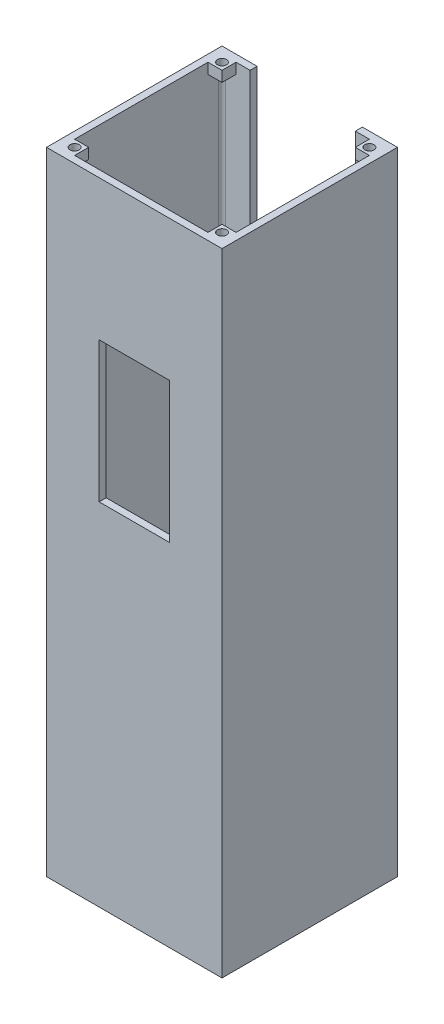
ISO-10303-21;
HEADER;
FILE_DESCRIPTION(('STEP AP214'),'2;1');
FILE_NAME('part.step','',(''),(''),'','','');
FILE_SCHEMA(('AUTOMOTIVE_DESIGN { 1 0 10303 214 1 1 1 1 }'));
ENDSEC;
DATA;
#1=APPLICATION_CONTEXT('core data for automotive mechanical design processes');
#2=APPLICATION_PROTOCOL_DEFINITION('international standard','automotive_design',2000,#1);
#3=PRODUCT_CONTEXT('',#1,'mechanical');
#4=PRODUCT('Part','Part','',(#3));
#5=PRODUCT_RELATED_PRODUCT_CATEGORY('part','',(#4));
#6=PRODUCT_DEFINITION_FORMATION('','',#4);
#7=PRODUCT_DEFINITION_CONTEXT('part definition',#1,'design');
#8=PRODUCT_DEFINITION('design','',#6,#7);
#9=PRODUCT_DEFINITION_SHAPE('','',#8);
#10=(LENGTH_UNIT() NAMED_UNIT(*) SI_UNIT(.MILLI.,.METRE.));
#11=(NAMED_UNIT(*) PLANE_ANGLE_UNIT() SI_UNIT($,.RADIAN.));
#12=(NAMED_UNIT(*) SI_UNIT($,.STERADIAN.) SOLID_ANGLE_UNIT());
#13=UNCERTAINTY_MEASURE_WITH_UNIT(LENGTH_MEASURE(1.E-05),#10,'distance_accuracy_value','');
#14=(GEOMETRIC_REPRESENTATION_CONTEXT(3) GLOBAL_UNCERTAINTY_ASSIGNED_CONTEXT((#13)) GLOBAL_UNIT_ASSIGNED_CONTEXT((#10,
#11,#12)) REPRESENTATION_CONTEXT('',''));
#15=CARTESIAN_POINT('',(0.,0.,0.));
#16=DIRECTION('',(0.,0.,1.));
#17=DIRECTION('',(1.,0.,0.));
#18=AXIS2_PLACEMENT_3D('',#15,#16,#17);
#19=CARTESIAN_POINT('',(0.,-302.26,-2.54));
#20=DIRECTION('',(0.,0.,1.));
#21=DIRECTION('',(1.,0.,0.));
#22=AXIS2_PLACEMENT_3D('',#19,#20,#21);
#23=PLANE('',#22);
#24=DIRECTION('',(0.,1.,0.));
#25=VECTOR('',#24,1.);
#26=CARTESIAN_POINT('',(55.88,-80.01,-2.54));
#27=LINE('',#26,#25);
#28=CARTESIAN_POINT('',(55.88,-80.01,-2.54));
#29=VERTEX_POINT('',#28);
#30=CARTESIAN_POINT('',(55.88,-76.2,-2.54));
#31=VERTEX_POINT('',#30);
#32=EDGE_CURVE('E68',#29,#31,#27,.T.);
#33=ORIENTED_EDGE('',*,*,#32,.F.);
#34=DIRECTION('',(-1.,0.,0.));
#35=VECTOR('',#34,1.);
#36=CARTESIAN_POINT('',(60.96,-80.01,-2.54));
#37=LINE('',#36,#35);
#38=CARTESIAN_POINT('',(59.69,-80.01,-2.54));
#39=VERTEX_POINT('',#38);
#40=EDGE_CURVE('E313',#39,#29,#37,.T.);
#41=ORIENTED_EDGE('',*,*,#40,.F.);
#42=DIRECTION('',(0.,1.,0.));
#43=VECTOR('',#42,1.);
#44=CARTESIAN_POINT('',(59.69,-302.26,-2.54));
#45=LINE('',#44,#43);
#46=CARTESIAN_POINT('',(59.69,-302.26,-2.54));
#47=VERTEX_POINT('',#46);
#48=EDGE_CURVE('E575',#39,#47,#45,.F.);
#49=ORIENTED_EDGE('',*,*,#48,.T.);
#50=DIRECTION('',(1.,0.,0.));
#51=VECTOR('',#50,1.);
#52=CARTESIAN_POINT('',(0.,-302.26,-2.54));
#53=LINE('',#52,#51);
#54=CARTESIAN_POINT('',(3.81,-302.26,-2.54));
#55=VERTEX_POINT('',#54);
#56=EDGE_CURVE('E536',#55,#47,#53,.T.);
#57=ORIENTED_EDGE('',*,*,#56,.F.);
#58=DIRECTION('',(0.,1.,0.));
#59=VECTOR('',#58,1.);
#60=CARTESIAN_POINT('',(3.81,-302.26,-2.54));
#61=LINE('',#60,#59);
#62=CARTESIAN_POINT('',(3.81,-80.01,-2.54));
#63=VERTEX_POINT('',#62);
#64=EDGE_CURVE('E589',#55,#63,#61,.T.);
#65=ORIENTED_EDGE('',*,*,#64,.T.);
#66=DIRECTION('',(-1.,0.,0.));
#67=VECTOR('',#66,1.);
#68=CARTESIAN_POINT('',(0.,-80.01,-2.54));
#69=LINE('',#68,#67);
#70=CARTESIAN_POINT('',(7.62,-80.01,-2.54));
#71=VERTEX_POINT('',#70);
#72=EDGE_CURVE('E376',#71,#63,#69,.T.);
#73=ORIENTED_EDGE('',*,*,#72,.F.);
#74=DIRECTION('',(0.,1.,0.));
#75=VECTOR('',#74,1.);
#76=CARTESIAN_POINT('',(7.62,-80.01,-2.54));
#77=LINE('',#76,#75);
#78=CARTESIAN_POINT('',(7.62,-76.2,-2.54));
#79=VERTEX_POINT('',#78);
#80=EDGE_CURVE('E339',#71,#79,#77,.T.);
#81=ORIENTED_EDGE('',*,*,#80,.T.);
#82=DIRECTION('',(1.,0.,0.));
#83=VECTOR('',#82,1.);
#84=CARTESIAN_POINT('',(0.,-76.2,-2.54));
#85=LINE('',#84,#83);
#86=EDGE_CURVE('E485',#79,#31,#85,.T.);
#87=ORIENTED_EDGE('',*,*,#86,.T.);
#88=EDGE_LOOP('',(#33,#41,#49,#57,#65,#73,#81,#87));
#89=FACE_BOUND('',#88,.T.);
#90=DIRECTION('',(0.,-1.,0.));
#91=VECTOR('',#90,1.);
#92=CARTESIAN_POINT('',(44.45,0.,-2.54));
#93=LINE('',#92,#91);
#94=CARTESIAN_POINT('',(44.45,-127.,-2.54));
#95=VERTEX_POINT('',#94);
#96=CARTESIAN_POINT('',(44.45,-177.8,-2.54));
#97=VERTEX_POINT('',#96);
#98=EDGE_CURVE('E533',#95,#97,#93,.T.);
#99=ORIENTED_EDGE('',*,*,#98,.F.);
#100=DIRECTION('',(1.,0.,0.));
#101=VECTOR('',#100,1.);
#102=CARTESIAN_POINT('',(0.,-127.,-2.54));
#103=LINE('',#102,#101);
#104=CARTESIAN_POINT('',(19.05,-127.,-2.54));
#105=VERTEX_POINT('',#104);
#106=EDGE_CURVE('E276',#105,#95,#103,.T.);
#107=ORIENTED_EDGE('',*,*,#106,.F.);
#108=DIRECTION('',(0.,-1.,0.));
#109=VECTOR('',#108,1.);
#110=CARTESIAN_POINT('',(19.05,0.,-2.54));
#111=LINE('',#110,#109);
#112=CARTESIAN_POINT('',(19.05,-177.8,-2.54));
#113=VERTEX_POINT('',#112);
#114=EDGE_CURVE('E266',#105,#113,#111,.T.);
#115=ORIENTED_EDGE('',*,*,#114,.T.);
#116=DIRECTION('',(-1.,0.,0.));
#117=VECTOR('',#116,1.);
#118=CARTESIAN_POINT('',(0.,-177.8,-2.54));
#119=LINE('',#118,#117);
#120=EDGE_CURVE('E289',#97,#113,#119,.T.);
#121=ORIENTED_EDGE('',*,*,#120,.F.);
#122=EDGE_LOOP('',(#99,#107,#115,#121));
#123=FACE_BOUND('',#122,.T.);
#124=ADVANCED_FACE('F44',(#89,#123),#23,.F.);
#125=CARTESIAN_POINT('',(0.,-304.8,0.));
#126=DIRECTION('',(0.,0.,1.));
#127=DIRECTION('',(1.,0.,0.));
#128=AXIS2_PLACEMENT_3D('',#125,#126,#127);
#129=PLANE('',#128);
#130=DIRECTION('',(1.,0.,0.));
#131=VECTOR('',#130,1.);
#132=CARTESIAN_POINT('',(0.,-76.2,0.));
#133=LINE('',#132,#131);
#134=CARTESIAN_POINT('',(0.,-76.2,0.));
#135=VERTEX_POINT('',#134);
#136=CARTESIAN_POINT('',(63.5,-76.2,0.));
#137=VERTEX_POINT('',#136);
#138=EDGE_CURVE('E472',#135,#137,#133,.T.);
#139=ORIENTED_EDGE('',*,*,#138,.F.);
#140=DIRECTION('',(0.,1.,0.));
#141=VECTOR('',#140,1.);
#142=CARTESIAN_POINT('',(0.,-304.8,0.));
#143=LINE('',#142,#141);
#144=CARTESIAN_POINT('',(0.,-304.8,0.));
#145=VERTEX_POINT('',#144);
#146=EDGE_CURVE('E570',#145,#135,#143,.T.);
#147=ORIENTED_EDGE('',*,*,#146,.F.);
#148=DIRECTION('',(1.,0.,0.));
#149=VECTOR('',#148,1.);
#150=CARTESIAN_POINT('',(0.,-304.8,0.));
#151=LINE('',#150,#149);
#152=CARTESIAN_POINT('',(63.5,-304.8,0.));
#153=VERTEX_POINT('',#152);
#154=EDGE_CURVE('E558',#145,#153,#151,.T.);
#155=ORIENTED_EDGE('',*,*,#154,.T.);
#156=DIRECTION('',(0.,1.,0.));
#157=VECTOR('',#156,1.);
#158=CARTESIAN_POINT('',(63.5,-304.8,0.));
#159=LINE('',#158,#157);
#160=EDGE_CURVE('E580',#153,#137,#159,.T.);
#161=ORIENTED_EDGE('',*,*,#160,.T.);
#162=EDGE_LOOP('',(#139,#147,#155,#161));
#163=FACE_BOUND('',#162,.T.);
#164=DIRECTION('',(1.,0.,0.));
#165=VECTOR('',#164,1.);
#166=CARTESIAN_POINT('',(0.,-127.,0.));
#167=LINE('',#166,#165);
#168=CARTESIAN_POINT('',(19.05,-127.,0.));
#169=VERTEX_POINT('',#168);
#170=CARTESIAN_POINT('',(44.45,-127.,0.));
#171=VERTEX_POINT('',#170);
#172=EDGE_CURVE('E274',#169,#171,#167,.T.);
#173=ORIENTED_EDGE('',*,*,#172,.T.);
#174=DIRECTION('',(0.,-1.,0.));
#175=VECTOR('',#174,1.);
#176=CARTESIAN_POINT('',(44.45,0.,0.));
#177=LINE('',#176,#175);
#178=CARTESIAN_POINT('',(44.45,-177.8,0.));
#179=VERTEX_POINT('',#178);
#180=EDGE_CURVE('E255',#171,#179,#177,.T.);
#181=ORIENTED_EDGE('',*,*,#180,.T.);
#182=DIRECTION('',(-1.,0.,0.));
#183=VECTOR('',#182,1.);
#184=CARTESIAN_POINT('',(0.,-177.8,0.));
#185=LINE('',#184,#183);
#186=CARTESIAN_POINT('',(19.05,-177.8,0.));
#187=VERTEX_POINT('',#186);
#188=EDGE_CURVE('E291',#179,#187,#185,.T.);
#189=ORIENTED_EDGE('',*,*,#188,.T.);
#190=DIRECTION('',(0.,-1.,0.));
#191=VECTOR('',#190,1.);
#192=CARTESIAN_POINT('',(19.05,0.,0.));
#193=LINE('',#192,#191);
#194=EDGE_CURVE('E267',#169,#187,#193,.T.);
#195=ORIENTED_EDGE('',*,*,#194,.F.);
#196=EDGE_LOOP('',(#173,#181,#189,#195));
#197=FACE_BOUND('',#196,.T.);
#198=ADVANCED_FACE('F280',(#163,#197),#129,.T.);
#199=CARTESIAN_POINT('',(59.69,-302.26,-3.81));
#200=DIRECTION('',(0.,-1.,0.));
#201=DIRECTION('',(0.,0.,-1.));
#202=AXIS2_PLACEMENT_3D('',#199,#200,#201);
#203=CYLINDRICAL_SURFACE('',#202,1.27);
#204=CARTESIAN_POINT('',(59.69,-80.01,-3.81));
#205=DIRECTION('',(0.,1.,0.));
#206=DIRECTION('',(0.,0.,1.));
#207=AXIS2_PLACEMENT_3D('',#204,#205,#206);
#208=CIRCLE('',#207,1.27);
#209=CARTESIAN_POINT('',(60.96,-80.01,-3.81));
#210=VERTEX_POINT('',#209);
#211=EDGE_CURVE('E11',#210,#39,#208,.F.);
#212=ORIENTED_EDGE('',*,*,#211,.F.);
#213=DIRECTION('',(0.,1.,0.));
#214=VECTOR('',#213,1.);
#215=CARTESIAN_POINT('',(60.96,-2.53999999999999,-3.81));
#216=LINE('',#215,#214);
#217=CARTESIAN_POINT('',(60.96,-302.26,-3.81));
#218=VERTEX_POINT('',#217);
#219=EDGE_CURVE('E619',#218,#210,#216,.T.);
#220=ORIENTED_EDGE('',*,*,#219,.F.);
#221=CARTESIAN_POINT('',(59.69,-302.26,-3.81));
#222=DIRECTION('',(0.,1.,0.));
#223=DIRECTION('',(0.,0.,1.));
#224=AXIS2_PLACEMENT_3D('',#221,#222,#223);
#225=CIRCLE('',#224,1.27);
#226=EDGE_CURVE('E600',#47,#218,#225,.T.);
#227=ORIENTED_EDGE('',*,*,#226,.F.);
#228=ORIENTED_EDGE('',*,*,#48,.F.);
#229=EDGE_LOOP('',(#212,#220,#227,#228));
#230=FACE_BOUND('',#229,.T.);
#231=ADVANCED_FACE('F46',(#230),#203,.F.);
#232=CARTESIAN_POINT('',(2.54,-302.26,0.));
#233=DIRECTION('',(1.,0.,0.));
#234=DIRECTION('',(0.,0.,-1.));
#235=AXIS2_PLACEMENT_3D('',#232,#233,#234);
#236=PLANE('',#235);
#237=DIRECTION('',(0.,0.,-1.));
#238=VECTOR('',#237,1.);
#239=CARTESIAN_POINT('',(2.54,-76.2,0.));
#240=LINE('',#239,#238);
#241=CARTESIAN_POINT('',(2.54,-76.2,-7.62));
#242=VERTEX_POINT('',#241);
#243=CARTESIAN_POINT('',(2.54,-76.2,-55.88));
#244=VERTEX_POINT('',#243);
#245=EDGE_CURVE('E488',#242,#244,#240,.T.);
#246=ORIENTED_EDGE('',*,*,#245,.F.);
#247=DIRECTION('',(0.,1.,0.));
#248=VECTOR('',#247,1.);
#249=CARTESIAN_POINT('',(2.54,-80.01,-7.62));
#250=LINE('',#249,#248);
#251=CARTESIAN_POINT('',(2.54,-80.01,-7.62));
#252=VERTEX_POINT('',#251);
#253=EDGE_CURVE('E327',#252,#242,#250,.T.);
#254=ORIENTED_EDGE('',*,*,#253,.F.);
#255=DIRECTION('',(0.,0.,-1.));
#256=VECTOR('',#255,1.);
#257=CARTESIAN_POINT('',(2.54,-80.01,0.));
#258=LINE('',#257,#256);
#259=CARTESIAN_POINT('',(2.54,-80.01,-3.81));
#260=VERTEX_POINT('',#259);
#261=EDGE_CURVE('E366',#260,#252,#258,.T.);
#262=ORIENTED_EDGE('',*,*,#261,.F.);
#263=DIRECTION('',(0.,1.,0.));
#264=VECTOR('',#263,1.);
#265=CARTESIAN_POINT('',(2.54,-302.26,-3.81));
#266=LINE('',#265,#264);
#267=CARTESIAN_POINT('',(2.54,-302.26,-3.81));
#268=VERTEX_POINT('',#267);
#269=EDGE_CURVE('E597',#260,#268,#266,.F.);
#270=ORIENTED_EDGE('',*,*,#269,.T.);
#271=DIRECTION('',(0.,0.,-1.));
#272=VECTOR('',#271,1.);
#273=CARTESIAN_POINT('',(2.54,-302.26,0.));
#274=LINE('',#273,#272);
#275=CARTESIAN_POINT('',(2.54,-302.26,-59.69));
#276=VERTEX_POINT('',#275);
#277=EDGE_CURVE('E550',#268,#276,#274,.T.);
#278=ORIENTED_EDGE('',*,*,#277,.T.);
#279=DIRECTION('',(0.,1.,0.));
#280=VECTOR('',#279,1.);
#281=CARTESIAN_POINT('',(2.54,-2.53999999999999,-59.69));
#282=LINE('',#281,#280);
#283=CARTESIAN_POINT('',(2.54,-80.01,-59.69));
#284=VERTEX_POINT('',#283);
#285=EDGE_CURVE('E593',#276,#284,#282,.T.);
#286=ORIENTED_EDGE('',*,*,#285,.T.);
#287=DIRECTION('',(0.,0.,-1.));
#288=VECTOR('',#287,1.);
#289=CARTESIAN_POINT('',(2.54,-80.01,0.));
#290=LINE('',#289,#288);
#291=CARTESIAN_POINT('',(2.54,-80.01,-55.88));
#292=VERTEX_POINT('',#291);
#293=EDGE_CURVE('E441',#292,#284,#290,.T.);
#294=ORIENTED_EDGE('',*,*,#293,.F.);
#295=DIRECTION('',(0.,1.,0.));
#296=VECTOR('',#295,1.);
#297=CARTESIAN_POINT('',(2.54,-80.01,-55.88));
#298=LINE('',#297,#296);
#299=EDGE_CURVE('E463',#292,#244,#298,.T.);
#300=ORIENTED_EDGE('',*,*,#299,.T.);
#301=EDGE_LOOP('',(#246,#254,#262,#270,#278,#286,#294,#300));
#302=FACE_BOUND('',#301,.T.);
#303=ADVANCED_FACE('F713',(#302),#236,.T.);
#304=CARTESIAN_POINT('',(3.81,-302.26,-3.81));
#305=DIRECTION('',(0.,1.,0.));
#306=DIRECTION('',(0.,0.,1.));
#307=AXIS2_PLACEMENT_3D('',#304,#305,#306);
#308=CYLINDRICAL_SURFACE('',#307,1.27);
#309=CARTESIAN_POINT('',(3.81,-80.01,-3.81));
#310=DIRECTION('',(0.,1.,0.));
#311=DIRECTION('',(0.,0.,1.));
#312=AXIS2_PLACEMENT_3D('',#309,#310,#311);
#313=CIRCLE('',#312,1.27);
#314=EDGE_CURVE('E343',#63,#260,#313,.F.);
#315=ORIENTED_EDGE('',*,*,#314,.F.);
#316=ORIENTED_EDGE('',*,*,#64,.F.);
#317=CARTESIAN_POINT('',(3.81,-302.26,-3.81));
#318=DIRECTION('',(0.,1.,0.));
#319=DIRECTION('',(0.,0.,1.));
#320=AXIS2_PLACEMENT_3D('',#317,#318,#319);
#321=CIRCLE('',#320,1.27);
#322=EDGE_CURVE('E609',#268,#55,#321,.T.);
#323=ORIENTED_EDGE('',*,*,#322,.F.);
#324=ORIENTED_EDGE('',*,*,#269,.F.);
#325=EDGE_LOOP('',(#315,#316,#323,#324));
#326=FACE_BOUND('',#325,.T.);
#327=ADVANCED_FACE('F709',(#326),#308,.F.);
#328=CARTESIAN_POINT('',(60.96,-302.26,0.));
#329=DIRECTION('',(1.,0.,0.));
#330=DIRECTION('',(0.,0.,-1.));
#331=AXIS2_PLACEMENT_3D('',#328,#329,#330);
#332=PLANE('',#331);
#333=DIRECTION('',(0.,0.,-1.));
#334=VECTOR('',#333,1.);
#335=CARTESIAN_POINT('',(60.96,-80.01,-2.54));
#336=LINE('',#335,#334);
#337=CARTESIAN_POINT('',(60.96,-80.01,-7.62000000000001));
#338=VERTEX_POINT('',#337);
#339=EDGE_CURVE('E60',#210,#338,#336,.T.);
#340=ORIENTED_EDGE('',*,*,#339,.T.);
#341=DIRECTION('',(0.,1.,0.));
#342=VECTOR('',#341,1.);
#343=CARTESIAN_POINT('',(60.96,-80.01,-7.62000000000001));
#344=LINE('',#343,#342);
#345=CARTESIAN_POINT('',(60.96,-76.2,-7.62000000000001));
#346=VERTEX_POINT('',#345);
#347=EDGE_CURVE('E310',#338,#346,#344,.T.);
#348=ORIENTED_EDGE('',*,*,#347,.T.);
#349=DIRECTION('',(0.,0.,-1.));
#350=VECTOR('',#349,1.);
#351=CARTESIAN_POINT('',(60.96,-76.2,0.));
#352=LINE('',#351,#350);
#353=CARTESIAN_POINT('',(60.96,-76.2,-55.88));
#354=VERTEX_POINT('',#353);
#355=EDGE_CURVE('E482',#346,#354,#352,.T.);
#356=ORIENTED_EDGE('',*,*,#355,.T.);
#357=DIRECTION('',(0.,1.,0.));
#358=VECTOR('',#357,1.);
#359=CARTESIAN_POINT('',(60.96,-80.01,-55.88));
#360=LINE('',#359,#358);
#361=CARTESIAN_POINT('',(60.96,-80.01,-55.88));
#362=VERTEX_POINT('',#361);
#363=EDGE_CURVE('E363',#362,#354,#360,.T.);
#364=ORIENTED_EDGE('',*,*,#363,.F.);
#365=DIRECTION('',(0.,0.,1.));
#366=VECTOR('',#365,1.);
#367=CARTESIAN_POINT('',(60.96,-80.01,0.));
#368=LINE('',#367,#366);
#369=CARTESIAN_POINT('',(60.96,-80.01,-59.69));
#370=VERTEX_POINT('',#369);
#371=EDGE_CURVE('E409',#370,#362,#368,.T.);
#372=ORIENTED_EDGE('',*,*,#371,.F.);
#373=DIRECTION('',(0.,1.,0.));
#374=VECTOR('',#373,1.);
#375=CARTESIAN_POINT('',(60.96,-302.26,-59.69));
#376=LINE('',#375,#374);
#377=CARTESIAN_POINT('',(60.96,-302.26,-59.69));
#378=VERTEX_POINT('',#377);
#379=EDGE_CURVE('E53',#370,#378,#376,.F.);
#380=ORIENTED_EDGE('',*,*,#379,.T.);
#381=DIRECTION('',(0.,0.,-1.));
#382=VECTOR('',#381,1.);
#383=CARTESIAN_POINT('',(60.96,-302.26,0.));
#384=LINE('',#383,#382);
#385=EDGE_CURVE('E542',#218,#378,#384,.T.);
#386=ORIENTED_EDGE('',*,*,#385,.F.);
#387=ORIENTED_EDGE('',*,*,#219,.T.);
#388=EDGE_LOOP('',(#340,#348,#356,#364,#372,#380,#386,#387));
#389=FACE_BOUND('',#388,.T.);
#390=ADVANCED_FACE('F624',(#389),#332,.F.);
#391=CARTESIAN_POINT('',(59.69,-302.26,-59.69));
#392=DIRECTION('',(0.,1.,0.));
#393=DIRECTION('',(0.,0.,1.));
#394=AXIS2_PLACEMENT_3D('',#391,#392,#393);
#395=CYLINDRICAL_SURFACE('',#394,1.27);
#396=CARTESIAN_POINT('',(59.69,-80.01,-59.69));
#397=DIRECTION('',(0.,1.,0.));
#398=DIRECTION('',(0.,0.,1.));
#399=AXIS2_PLACEMENT_3D('',#396,#397,#398);
#400=CIRCLE('',#399,1.27);
#401=CARTESIAN_POINT('',(59.69,-80.01,-60.96));
#402=VERTEX_POINT('',#401);
#403=EDGE_CURVE('E385',#402,#370,#400,.F.);
#404=ORIENTED_EDGE('',*,*,#403,.F.);
#405=DIRECTION('',(0.,1.,0.));
#406=VECTOR('',#405,1.);
#407=CARTESIAN_POINT('',(59.69,-302.26,-60.96));
#408=LINE('',#407,#406);
#409=CARTESIAN_POINT('',(59.69,-302.26,-60.96));
#410=VERTEX_POINT('',#409);
#411=EDGE_CURVE('E612',#410,#402,#408,.T.);
#412=ORIENTED_EDGE('',*,*,#411,.F.);
#413=CARTESIAN_POINT('',(59.69,-302.26,-59.69));
#414=DIRECTION('',(0.,1.,0.));
#415=DIRECTION('',(0.,0.,1.));
#416=AXIS2_PLACEMENT_3D('',#413,#414,#415);
#417=CIRCLE('',#416,1.27);
#418=EDGE_CURVE('E603',#378,#410,#417,.T.);
#419=ORIENTED_EDGE('',*,*,#418,.F.);
#420=ORIENTED_EDGE('',*,*,#379,.F.);
#421=EDGE_LOOP('',(#404,#412,#419,#420));
#422=FACE_BOUND('',#421,.T.);
#423=ADVANCED_FACE('F634',(#422),#395,.F.);
#424=CARTESIAN_POINT('',(0.,-302.26,-60.96));
#425=DIRECTION('',(0.,0.,1.));
#426=DIRECTION('',(1.,0.,0.));
#427=AXIS2_PLACEMENT_3D('',#424,#425,#426);
#428=PLANE('',#427);
#429=DIRECTION('',(0.,1.,0.));
#430=VECTOR('',#429,1.);
#431=CARTESIAN_POINT('',(55.88,-80.01,-60.96));
#432=LINE('',#431,#430);
#433=CARTESIAN_POINT('',(55.88,-80.01,-60.96));
#434=VERTEX_POINT('',#433);
#435=CARTESIAN_POINT('',(55.88,-76.2,-60.96));
#436=VERTEX_POINT('',#435);
#437=EDGE_CURVE('E382',#434,#436,#432,.T.);
#438=ORIENTED_EDGE('',*,*,#437,.T.);
#439=DIRECTION('',(1.,0.,0.));
#440=VECTOR('',#439,1.);
#441=CARTESIAN_POINT('',(0.,-76.2,-60.96));
#442=LINE('',#441,#440);
#443=CARTESIAN_POINT('',(50.8,-76.2,-60.96));
#444=VERTEX_POINT('',#443);
#445=EDGE_CURVE('E491',#444,#436,#442,.T.);
#446=ORIENTED_EDGE('',*,*,#445,.F.);
#447=DIRECTION('',(0.,-1.,0.));
#448=VECTOR('',#447,1.);
#449=CARTESIAN_POINT('',(50.8,0.,-60.96));
#450=LINE('',#449,#448);
#451=CARTESIAN_POINT('',(50.8,-292.1,-60.96));
#452=VERTEX_POINT('',#451);
#453=EDGE_CURVE('E504',#444,#452,#450,.T.);
#454=ORIENTED_EDGE('',*,*,#453,.T.);
#455=DIRECTION('',(1.,0.,0.));
#456=VECTOR('',#455,1.);
#457=CARTESIAN_POINT('',(0.,-292.1,-60.96));
#458=LINE('',#457,#456);
#459=CARTESIAN_POINT('',(12.7,-292.1,-60.96));
#460=VERTEX_POINT('',#459);
#461=EDGE_CURVE('E507',#460,#452,#458,.T.);
#462=ORIENTED_EDGE('',*,*,#461,.F.);
#463=DIRECTION('',(0.,-1.,0.));
#464=VECTOR('',#463,1.);
#465=CARTESIAN_POINT('',(12.7,0.,-60.96));
#466=LINE('',#465,#464);
#467=CARTESIAN_POINT('',(12.7,-76.2,-60.96));
#468=VERTEX_POINT('',#467);
#469=EDGE_CURVE('E512',#468,#460,#466,.T.);
#470=ORIENTED_EDGE('',*,*,#469,.F.);
#471=CARTESIAN_POINT('',(7.62,-76.2,-60.96));
#472=VERTEX_POINT('',#471);
#473=EDGE_CURVE('E496',#472,#468,#442,.T.);
#474=ORIENTED_EDGE('',*,*,#473,.F.);
#475=DIRECTION('',(0.,1.,0.));
#476=VECTOR('',#475,1.);
#477=CARTESIAN_POINT('',(7.62,-80.01,-60.96));
#478=LINE('',#477,#476);
#479=CARTESIAN_POINT('',(7.62,-80.01,-60.96));
#480=VERTEX_POINT('',#479);
#481=EDGE_CURVE('E448',#480,#472,#478,.T.);
#482=ORIENTED_EDGE('',*,*,#481,.F.);
#483=DIRECTION('',(1.,0.,0.));
#484=VECTOR('',#483,1.);
#485=CARTESIAN_POINT('',(0.,-80.01,-60.96));
#486=LINE('',#485,#484);
#487=CARTESIAN_POINT('',(3.81,-80.01,-60.96));
#488=VERTEX_POINT('',#487);
#489=EDGE_CURVE('E435',#488,#480,#486,.T.);
#490=ORIENTED_EDGE('',*,*,#489,.F.);
#491=DIRECTION('',(0.,1.,0.));
#492=VECTOR('',#491,1.);
#493=CARTESIAN_POINT('',(3.81,-302.26,-60.96));
#494=LINE('',#493,#492);
#495=CARTESIAN_POINT('',(3.81,-302.26,-60.96));
#496=VERTEX_POINT('',#495);
#497=EDGE_CURVE('E616',#488,#496,#494,.F.);
#498=ORIENTED_EDGE('',*,*,#497,.T.);
#499=DIRECTION('',(1.,0.,0.));
#500=VECTOR('',#499,1.);
#501=CARTESIAN_POINT('',(0.,-302.26,-60.96));
#502=LINE('',#501,#500);
#503=EDGE_CURVE('E546',#496,#410,#502,.T.);
#504=ORIENTED_EDGE('',*,*,#503,.T.);
#505=ORIENTED_EDGE('',*,*,#411,.T.);
#506=DIRECTION('',(1.,0.,0.));
#507=VECTOR('',#506,1.);
#508=CARTESIAN_POINT('',(0.,-80.01,-60.96));
#509=LINE('',#508,#507);
#510=EDGE_CURVE('E420',#434,#402,#509,.T.);
#511=ORIENTED_EDGE('',*,*,#510,.F.);
#512=EDGE_LOOP('',(#438,#446,#454,#462,#470,#474,#482,#490,#498,#504,#505,#511));
#513=FACE_BOUND('',#512,.T.);
#514=ADVANCED_FACE('F636',(#513),#428,.T.);
#515=CARTESIAN_POINT('',(3.81,-302.26,-59.69));
#516=DIRECTION('',(0.,-1.,0.));
#517=DIRECTION('',(0.,0.,-1.));
#518=AXIS2_PLACEMENT_3D('',#515,#516,#517);
#519=CYLINDRICAL_SURFACE('',#518,1.27);
#520=CARTESIAN_POINT('',(3.81,-80.01,-59.69));
#521=DIRECTION('',(0.,1.,0.));
#522=DIRECTION('',(0.,0.,1.));
#523=AXIS2_PLACEMENT_3D('',#520,#521,#522);
#524=CIRCLE('',#523,1.27);
#525=EDGE_CURVE('E438',#284,#488,#524,.F.);
#526=ORIENTED_EDGE('',*,*,#525,.F.);
#527=ORIENTED_EDGE('',*,*,#285,.F.);
#528=CARTESIAN_POINT('',(3.81,-302.26,-59.69));
#529=DIRECTION('',(0.,1.,0.));
#530=DIRECTION('',(0.,0.,1.));
#531=AXIS2_PLACEMENT_3D('',#528,#529,#530);
#532=CIRCLE('',#531,1.27);
#533=EDGE_CURVE('E606',#496,#276,#532,.T.);
#534=ORIENTED_EDGE('',*,*,#533,.F.);
#535=ORIENTED_EDGE('',*,*,#497,.F.);
#536=EDGE_LOOP('',(#526,#527,#534,#535));
#537=FACE_BOUND('',#536,.T.);
#538=ADVANCED_FACE('F712',(#537),#519,.F.);
#539=CARTESIAN_POINT('',(0.,-304.8,0.));
#540=DIRECTION('',(-1.,0.,0.));
#541=DIRECTION('',(0.,0.,1.));
#542=AXIS2_PLACEMENT_3D('',#539,#540,#541);
#543=PLANE('',#542);
#544=DIRECTION('',(0.,0.,1.));
#545=VECTOR('',#544,1.);
#546=CARTESIAN_POINT('',(0.,-76.2,0.));
#547=LINE('',#546,#545);
#548=CARTESIAN_POINT('',(0.,-76.2,-63.5));
#549=VERTEX_POINT('',#548);
#550=EDGE_CURVE('E462',#549,#135,#547,.T.);
#551=ORIENTED_EDGE('',*,*,#550,.F.);
#552=DIRECTION('',(0.,1.,0.));
#553=VECTOR('',#552,1.);
#554=CARTESIAN_POINT('',(0.,-304.8,-63.5));
#555=LINE('',#554,#553);
#556=CARTESIAN_POINT('',(0.,-304.8,-63.5));
#557=VERTEX_POINT('',#556);
#558=EDGE_CURVE('E571',#557,#549,#555,.T.);
#559=ORIENTED_EDGE('',*,*,#558,.F.);
#560=DIRECTION('',(0.,0.,1.));
#561=VECTOR('',#560,1.);
#562=CARTESIAN_POINT('',(0.,-304.8,0.));
#563=LINE('',#562,#561);
#564=EDGE_CURVE('E554',#557,#145,#563,.T.);
#565=ORIENTED_EDGE('',*,*,#564,.T.);
#566=ORIENTED_EDGE('',*,*,#146,.T.);
#567=EDGE_LOOP('',(#551,#559,#565,#566));
#568=FACE_BOUND('',#567,.T.);
#569=ADVANCED_FACE('F679',(#568),#543,.T.);
#570=CARTESIAN_POINT('',(0.,-304.8,-63.5));
#571=DIRECTION('',(0.,0.,-1.));
#572=DIRECTION('',(-1.,0.,0.));
#573=AXIS2_PLACEMENT_3D('',#570,#571,#572);
#574=PLANE('',#573);
#575=DIRECTION('',(-1.,0.,0.));
#576=VECTOR('',#575,1.);
#577=CARTESIAN_POINT('',(0.,-76.2,-63.5));
#578=LINE('',#577,#576);
#579=CARTESIAN_POINT('',(63.5,-76.2,-63.5));
#580=VERTEX_POINT('',#579);
#581=CARTESIAN_POINT('',(50.8,-76.2,-63.5));
#582=VERTEX_POINT('',#581);
#583=EDGE_CURVE('E479',#580,#582,#578,.T.);
#584=ORIENTED_EDGE('',*,*,#583,.F.);
#585=DIRECTION('',(0.,1.,0.));
#586=VECTOR('',#585,1.);
#587=CARTESIAN_POINT('',(63.5,-304.8,-63.5));
#588=LINE('',#587,#586);
#589=CARTESIAN_POINT('',(63.5,-304.8,-63.5));
#590=VERTEX_POINT('',#589);
#591=EDGE_CURVE('E576',#590,#580,#588,.T.);
#592=ORIENTED_EDGE('',*,*,#591,.F.);
#593=DIRECTION('',(-1.,0.,0.));
#594=VECTOR('',#593,1.);
#595=CARTESIAN_POINT('',(0.,-304.8,-63.5));
#596=LINE('',#595,#594);
#597=EDGE_CURVE('E566',#590,#557,#596,.T.);
#598=ORIENTED_EDGE('',*,*,#597,.T.);
#599=ORIENTED_EDGE('',*,*,#558,.T.);
#600=CARTESIAN_POINT('',(12.7,-76.2,-63.5));
#601=VERTEX_POINT('',#600);
#602=EDGE_CURVE('E478',#601,#549,#578,.T.);
#603=ORIENTED_EDGE('',*,*,#602,.F.);
#604=DIRECTION('',(0.,-1.,0.));
#605=VECTOR('',#604,1.);
#606=CARTESIAN_POINT('',(12.7,0.,-63.5));
#607=LINE('',#606,#605);
#608=CARTESIAN_POINT('',(12.7,-292.1,-63.5));
#609=VERTEX_POINT('',#608);
#610=EDGE_CURVE('E508',#601,#609,#607,.T.);
#611=ORIENTED_EDGE('',*,*,#610,.T.);
#612=DIRECTION('',(1.,0.,0.));
#613=VECTOR('',#612,1.);
#614=CARTESIAN_POINT('',(0.,-292.1,-63.5));
#615=LINE('',#614,#613);
#616=CARTESIAN_POINT('',(50.8,-292.1,-63.5));
#617=VERTEX_POINT('',#616);
#618=EDGE_CURVE('E518',#609,#617,#615,.T.);
#619=ORIENTED_EDGE('',*,*,#618,.T.);
#620=DIRECTION('',(0.,-1.,0.));
#621=VECTOR('',#620,1.);
#622=CARTESIAN_POINT('',(50.8,0.,-63.5));
#623=LINE('',#622,#621);
#624=EDGE_CURVE('E503',#582,#617,#623,.T.);
#625=ORIENTED_EDGE('',*,*,#624,.F.);
#626=EDGE_LOOP('',(#584,#592,#598,#599,#603,#611,#619,#625));
#627=FACE_BOUND('',#626,.T.);
#628=ADVANCED_FACE('F659',(#627),#574,.T.);
#629=CARTESIAN_POINT('',(63.5,-304.8,0.));
#630=DIRECTION('',(1.,0.,0.));
#631=DIRECTION('',(0.,0.,-1.));
#632=AXIS2_PLACEMENT_3D('',#629,#630,#631);
#633=PLANE('',#632);
#634=DIRECTION('',(0.,0.,-1.));
#635=VECTOR('',#634,1.);
#636=CARTESIAN_POINT('',(63.5,-76.2,0.));
#637=LINE('',#636,#635);
#638=EDGE_CURVE('E475',#137,#580,#637,.T.);
#639=ORIENTED_EDGE('',*,*,#638,.F.);
#640=ORIENTED_EDGE('',*,*,#160,.F.);
#641=DIRECTION('',(0.,0.,-1.));
#642=VECTOR('',#641,1.);
#643=CARTESIAN_POINT('',(63.5,-304.8,0.));
#644=LINE('',#643,#642);
#645=EDGE_CURVE('E562',#153,#590,#644,.T.);
#646=ORIENTED_EDGE('',*,*,#645,.T.);
#647=ORIENTED_EDGE('',*,*,#591,.T.);
#648=EDGE_LOOP('',(#639,#640,#646,#647));
#649=FACE_BOUND('',#648,.T.);
#650=ADVANCED_FACE('F688',(#649),#633,.T.);
#651=CARTESIAN_POINT('',(0.,-304.8,0.));
#652=DIRECTION('',(0.,-1.,0.));
#653=DIRECTION('',(0.,0.,-1.));
#654=AXIS2_PLACEMENT_3D('',#651,#652,#653);
#655=PLANE('',#654);
#656=ORIENTED_EDGE('',*,*,#564,.F.);
#657=ORIENTED_EDGE('',*,*,#597,.F.);
#658=ORIENTED_EDGE('',*,*,#645,.F.);
#659=ORIENTED_EDGE('',*,*,#154,.F.);
#660=EDGE_LOOP('',(#656,#657,#658,#659));
#661=FACE_BOUND('',#660,.T.);
#662=ADVANCED_FACE('F682',(#661),#655,.T.);
#663=CARTESIAN_POINT('',(0.,-302.26,0.));
#664=DIRECTION('',(0.,1.,0.));
#665=DIRECTION('',(0.,0.,1.));
#666=AXIS2_PLACEMENT_3D('',#663,#664,#665);
#667=PLANE('',#666);
#668=ORIENTED_EDGE('',*,*,#277,.F.);
#669=ORIENTED_EDGE('',*,*,#322,.T.);
#670=ORIENTED_EDGE('',*,*,#56,.T.);
#671=ORIENTED_EDGE('',*,*,#226,.T.);
#672=ORIENTED_EDGE('',*,*,#385,.T.);
#673=ORIENTED_EDGE('',*,*,#418,.T.);
#674=ORIENTED_EDGE('',*,*,#503,.F.);
#675=ORIENTED_EDGE('',*,*,#533,.T.);
#676=EDGE_LOOP('',(#668,#669,#670,#671,#672,#673,#674,#675));
#677=FACE_BOUND('',#676,.T.);
#678=ADVANCED_FACE('F630',(#677),#667,.T.);
#679=CARTESIAN_POINT('',(19.05,0.,-2.54));
#680=DIRECTION('',(-1.,0.,0.));
#681=DIRECTION('',(0.,0.,1.));
#682=AXIS2_PLACEMENT_3D('',#679,#680,#681);
#683=PLANE('',#682);
#684=ORIENTED_EDGE('',*,*,#194,.T.);
#685=DIRECTION('',(0.,0.,1.));
#686=VECTOR('',#685,1.);
#687=CARTESIAN_POINT('',(19.05,-177.8,-5.08));
#688=LINE('',#687,#686);
#689=EDGE_CURVE('E285',#113,#187,#688,.T.);
#690=ORIENTED_EDGE('',*,*,#689,.F.);
#691=ORIENTED_EDGE('',*,*,#114,.F.);
#692=DIRECTION('',(0.,0.,1.));
#693=VECTOR('',#692,1.);
#694=CARTESIAN_POINT('',(19.05,-127.,-5.08));
#695=LINE('',#694,#693);
#696=EDGE_CURVE('E278',#105,#169,#695,.T.);
#697=ORIENTED_EDGE('',*,*,#696,.T.);
#698=EDGE_LOOP('',(#684,#690,#691,#697));
#699=FACE_BOUND('',#698,.T.);
#700=ADVANCED_FACE('F719',(#699),#683,.F.);
#701=CARTESIAN_POINT('',(44.45,0.,-2.54));
#702=DIRECTION('',(-1.,0.,0.));
#703=DIRECTION('',(0.,0.,1.));
#704=AXIS2_PLACEMENT_3D('',#701,#702,#703);
#705=PLANE('',#704);
#706=ORIENTED_EDGE('',*,*,#180,.F.);
#707=DIRECTION('',(0.,0.,1.));
#708=VECTOR('',#707,1.);
#709=CARTESIAN_POINT('',(44.45,-127.,-5.08));
#710=LINE('',#709,#708);
#711=EDGE_CURVE('E258',#95,#171,#710,.T.);
#712=ORIENTED_EDGE('',*,*,#711,.F.);
#713=ORIENTED_EDGE('',*,*,#98,.T.);
#714=DIRECTION('',(0.,0.,1.));
#715=VECTOR('',#714,1.);
#716=CARTESIAN_POINT('',(44.45,-177.8,-5.08));
#717=LINE('',#716,#715);
#718=EDGE_CURVE('E260',#97,#179,#717,.T.);
#719=ORIENTED_EDGE('',*,*,#718,.T.);
#720=EDGE_LOOP('',(#706,#712,#713,#719));
#721=FACE_BOUND('',#720,.T.);
#722=ADVANCED_FACE('F257',(#721),#705,.T.);
#723=CARTESIAN_POINT('',(12.7,0.,-60.96));
#724=DIRECTION('',(1.,0.,0.));
#725=DIRECTION('',(0.,0.,-1.));
#726=AXIS2_PLACEMENT_3D('',#723,#724,#725);
#727=PLANE('',#726);
#728=DIRECTION('',(0.,0.,-1.));
#729=VECTOR('',#728,1.);
#730=CARTESIAN_POINT('',(12.7,-76.2,-60.96));
#731=LINE('',#730,#729);
#732=EDGE_CURVE('E500',#468,#601,#731,.T.);
#733=ORIENTED_EDGE('',*,*,#732,.F.);
#734=ORIENTED_EDGE('',*,*,#469,.T.);
#735=DIRECTION('',(0.,0.,-1.));
#736=VECTOR('',#735,1.);
#737=CARTESIAN_POINT('',(12.7,-292.1,-60.96));
#738=LINE('',#737,#736);
#739=EDGE_CURVE('E524',#460,#609,#738,.T.);
#740=ORIENTED_EDGE('',*,*,#739,.T.);
#741=ORIENTED_EDGE('',*,*,#610,.F.);
#742=EDGE_LOOP('',(#733,#734,#740,#741));
#743=FACE_BOUND('',#742,.T.);
#744=ADVANCED_FACE('F672',(#743),#727,.T.);
#745=CARTESIAN_POINT('',(0.,-292.1,-60.96));
#746=DIRECTION('',(0.,1.,0.));
#747=DIRECTION('',(0.,0.,1.));
#748=AXIS2_PLACEMENT_3D('',#745,#746,#747);
#749=PLANE('',#748);
#750=ORIENTED_EDGE('',*,*,#618,.F.);
#751=ORIENTED_EDGE('',*,*,#739,.F.);
#752=ORIENTED_EDGE('',*,*,#461,.T.);
#753=DIRECTION('',(0.,0.,-1.));
#754=VECTOR('',#753,1.);
#755=CARTESIAN_POINT('',(50.8,-292.1,-60.96));
#756=LINE('',#755,#754);
#757=EDGE_CURVE('E515',#452,#617,#756,.T.);
#758=ORIENTED_EDGE('',*,*,#757,.T.);
#759=EDGE_LOOP('',(#750,#751,#752,#758));
#760=FACE_BOUND('',#759,.T.);
#761=ADVANCED_FACE('F665',(#760),#749,.T.);
#762=CARTESIAN_POINT('',(50.8,0.,-60.96));
#763=DIRECTION('',(1.,0.,0.));
#764=DIRECTION('',(0.,0.,-1.));
#765=AXIS2_PLACEMENT_3D('',#762,#763,#764);
#766=PLANE('',#765);
#767=ORIENTED_EDGE('',*,*,#453,.F.);
#768=DIRECTION('',(0.,0.,-1.));
#769=VECTOR('',#768,1.);
#770=CARTESIAN_POINT('',(50.8,-76.2,-60.96));
#771=LINE('',#770,#769);
#772=EDGE_CURVE('E495',#444,#582,#771,.T.);
#773=ORIENTED_EDGE('',*,*,#772,.T.);
#774=ORIENTED_EDGE('',*,*,#624,.T.);
#775=ORIENTED_EDGE('',*,*,#757,.F.);
#776=EDGE_LOOP('',(#767,#773,#774,#775));
#777=FACE_BOUND('',#776,.T.);
#778=ADVANCED_FACE('F656',(#777),#766,.F.);
#779=CARTESIAN_POINT('',(0.,-76.2,0.));
#780=DIRECTION('',(0.,-1.,0.));
#781=DIRECTION('',(0.,0.,-1.));
#782=AXIS2_PLACEMENT_3D('',#779,#780,#781);
#783=PLANE('',#782);
#784=CARTESIAN_POINT('',(58.42,-76.2,-5.08));
#785=DIRECTION('',(0.,1.,0.));
#786=DIRECTION('',(0.,0.,1.));
#787=AXIS2_PLACEMENT_3D('',#784,#785,#786);
#788=CIRCLE('',#787,1.651);
#789=CARTESIAN_POINT('',(58.42,-76.2,-3.429));
#790=VERTEX_POINT('',#789);
#791=EDGE_CURVE('E302',#790,#790,#788,.T.);
#792=ORIENTED_EDGE('',*,*,#791,.F.);
#793=EDGE_LOOP('',(#792));
#794=FACE_BOUND('',#793,.T.);
#795=ORIENTED_EDGE('',*,*,#355,.F.);
#796=DIRECTION('',(-1.,0.,0.));
#797=VECTOR('',#796,1.);
#798=CARTESIAN_POINT('',(60.96,-76.2,-7.62000000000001));
#799=LINE('',#798,#797);
#800=CARTESIAN_POINT('',(55.88,-76.2,-7.62));
#801=VERTEX_POINT('',#800);
#802=EDGE_CURVE('E323',#346,#801,#799,.T.);
#803=ORIENTED_EDGE('',*,*,#802,.T.);
#804=DIRECTION('',(0.,0.,-1.));
#805=VECTOR('',#804,1.);
#806=CARTESIAN_POINT('',(55.88,-76.2,-2.54));
#807=LINE('',#806,#805);
#808=EDGE_CURVE('E319',#31,#801,#807,.T.);
#809=ORIENTED_EDGE('',*,*,#808,.F.);
#810=ORIENTED_EDGE('',*,*,#86,.F.);
#811=DIRECTION('',(0.,0.,-1.));
#812=VECTOR('',#811,1.);
#813=CARTESIAN_POINT('',(7.62,-76.2,0.));
#814=LINE('',#813,#812);
#815=CARTESIAN_POINT('',(7.62,-76.2,-7.62));
#816=VERTEX_POINT('',#815);
#817=EDGE_CURVE('E354',#79,#816,#814,.T.);
#818=ORIENTED_EDGE('',*,*,#817,.T.);
#819=DIRECTION('',(1.,0.,0.));
#820=VECTOR('',#819,1.);
#821=CARTESIAN_POINT('',(0.,-76.2,-7.62));
#822=LINE('',#821,#820);
#823=EDGE_CURVE('E350',#242,#816,#822,.T.);
#824=ORIENTED_EDGE('',*,*,#823,.F.);
#825=ORIENTED_EDGE('',*,*,#245,.T.);
#826=DIRECTION('',(1.,0.,0.));
#827=VECTOR('',#826,1.);
#828=CARTESIAN_POINT('',(0.,-76.2,-55.88));
#829=LINE('',#828,#827);
#830=CARTESIAN_POINT('',(7.62,-76.2,-55.88));
#831=VERTEX_POINT('',#830);
#832=EDGE_CURVE('E432',#244,#831,#829,.T.);
#833=ORIENTED_EDGE('',*,*,#832,.T.);
#834=DIRECTION('',(0.,0.,1.));
#835=VECTOR('',#834,1.);
#836=CARTESIAN_POINT('',(7.62,-76.2,0.));
#837=LINE('',#836,#835);
#838=EDGE_CURVE('E452',#472,#831,#837,.T.);
#839=ORIENTED_EDGE('',*,*,#838,.F.);
#840=ORIENTED_EDGE('',*,*,#473,.T.);
#841=ORIENTED_EDGE('',*,*,#732,.T.);
#842=ORIENTED_EDGE('',*,*,#602,.T.);
#843=ORIENTED_EDGE('',*,*,#550,.T.);
#844=ORIENTED_EDGE('',*,*,#138,.T.);
#845=ORIENTED_EDGE('',*,*,#638,.T.);
#846=ORIENTED_EDGE('',*,*,#583,.T.);
#847=ORIENTED_EDGE('',*,*,#772,.F.);
#848=ORIENTED_EDGE('',*,*,#445,.T.);
#849=DIRECTION('',(0.,0.,1.));
#850=VECTOR('',#849,1.);
#851=CARTESIAN_POINT('',(55.88,-76.2,0.));
#852=LINE('',#851,#850);
#853=CARTESIAN_POINT('',(55.88,-76.2,-55.88));
#854=VERTEX_POINT('',#853);
#855=EDGE_CURVE('E396',#436,#854,#852,.T.);
#856=ORIENTED_EDGE('',*,*,#855,.T.);
#857=DIRECTION('',(-1.,0.,0.));
#858=VECTOR('',#857,1.);
#859=CARTESIAN_POINT('',(0.,-76.2,-55.88));
#860=LINE('',#859,#858);
#861=EDGE_CURVE('E392',#354,#854,#860,.T.);
#862=ORIENTED_EDGE('',*,*,#861,.F.);
#863=EDGE_LOOP('',(#795,#803,#809,#810,#818,#824,#825,#833,#839,#840,#841,#842,#843,#844,#845,
#846,#847,#848,#856,#862));
#864=FACE_BOUND('',#863,.T.);
#865=CARTESIAN_POINT('',(5.08,-76.2,-58.42));
#866=DIRECTION('',(0.,1.,0.));
#867=DIRECTION('',(0.,0.,1.));
#868=AXIS2_PLACEMENT_3D('',#865,#866,#867);
#869=CIRCLE('',#868,1.651);
#870=CARTESIAN_POINT('',(5.08,-76.2,-56.769));
#871=VERTEX_POINT('',#870);
#872=EDGE_CURVE('E405',#871,#871,#869,.T.);
#873=ORIENTED_EDGE('',*,*,#872,.F.);
#874=EDGE_LOOP('',(#873));
#875=FACE_BOUND('',#874,.T.);
#876=CARTESIAN_POINT('',(58.42,-76.2,-58.42));
#877=DIRECTION('',(0.,1.,0.));
#878=DIRECTION('',(0.,0.,1.));
#879=AXIS2_PLACEMENT_3D('',#876,#877,#878);
#880=CIRCLE('',#879,1.651);
#881=CARTESIAN_POINT('',(58.42,-76.2,-56.769));
#882=VERTEX_POINT('',#881);
#883=EDGE_CURVE('E401',#882,#882,#880,.T.);
#884=ORIENTED_EDGE('',*,*,#883,.F.);
#885=EDGE_LOOP('',(#884));
#886=FACE_BOUND('',#885,.T.);
#887=CARTESIAN_POINT('',(5.08,-76.2,-5.08));
#888=DIRECTION('',(0.,1.,0.));
#889=DIRECTION('',(0.,0.,1.));
#890=AXIS2_PLACEMENT_3D('',#887,#888,#889);
#891=CIRCLE('',#890,1.651);
#892=CARTESIAN_POINT('',(5.08,-76.2,-3.429));
#893=VERTEX_POINT('',#892);
#894=EDGE_CURVE('E359',#893,#893,#891,.T.);
#895=ORIENTED_EDGE('',*,*,#894,.F.);
#896=EDGE_LOOP('',(#895));
#897=FACE_BOUND('',#896,.T.);
#898=ADVANCED_FACE('F650',(#794,#864,#875,#886,#897),#783,.F.);
#899=CARTESIAN_POINT('',(7.62,-80.01,0.));
#900=DIRECTION('',(-1.,0.,0.));
#901=DIRECTION('',(0.,0.,1.));
#902=AXIS2_PLACEMENT_3D('',#899,#900,#901);
#903=PLANE('',#902);
#904=ORIENTED_EDGE('',*,*,#838,.T.);
#905=DIRECTION('',(0.,1.,0.));
#906=VECTOR('',#905,1.);
#907=CARTESIAN_POINT('',(7.62,-80.01,-55.88));
#908=LINE('',#907,#906);
#909=CARTESIAN_POINT('',(7.62,-80.01,-55.88));
#910=VERTEX_POINT('',#909);
#911=EDGE_CURVE('E459',#910,#831,#908,.T.);
#912=ORIENTED_EDGE('',*,*,#911,.F.);
#913=DIRECTION('',(0.,0.,1.));
#914=VECTOR('',#913,1.);
#915=CARTESIAN_POINT('',(7.62,-80.01,0.));
#916=LINE('',#915,#914);
#917=EDGE_CURVE('E431',#480,#910,#916,.T.);
#918=ORIENTED_EDGE('',*,*,#917,.F.);
#919=ORIENTED_EDGE('',*,*,#481,.T.);
#920=EDGE_LOOP('',(#904,#912,#918,#919));
#921=FACE_BOUND('',#920,.T.);
#922=ADVANCED_FACE('F733',(#921),#903,.F.);
#923=CARTESIAN_POINT('',(0.,-80.01,-55.88));
#924=DIRECTION('',(0.,0.,1.));
#925=DIRECTION('',(1.,0.,0.));
#926=AXIS2_PLACEMENT_3D('',#923,#924,#925);
#927=PLANE('',#926);
#928=ORIENTED_EDGE('',*,*,#832,.F.);
#929=ORIENTED_EDGE('',*,*,#299,.F.);
#930=DIRECTION('',(1.,0.,0.));
#931=VECTOR('',#930,1.);
#932=CARTESIAN_POINT('',(0.,-80.01,-55.88));
#933=LINE('',#932,#931);
#934=EDGE_CURVE('E444',#292,#910,#933,.T.);
#935=ORIENTED_EDGE('',*,*,#934,.T.);
#936=ORIENTED_EDGE('',*,*,#911,.T.);
#937=EDGE_LOOP('',(#928,#929,#935,#936));
#938=FACE_BOUND('',#937,.T.);
#939=ADVANCED_FACE('F739',(#938),#927,.T.);
#940=CARTESIAN_POINT('',(5.08,-80.01,-58.42));
#941=DIRECTION('',(0.,1.,0.));
#942=DIRECTION('',(0.,0.,1.));
#943=AXIS2_PLACEMENT_3D('',#940,#941,#942);
#944=CYLINDRICAL_SURFACE('',#943,1.651);
#945=CARTESIAN_POINT('',(5.08,-80.01,-58.42));
#946=DIRECTION('',(0.,1.,0.));
#947=DIRECTION('',(0.,0.,1.));
#948=AXIS2_PLACEMENT_3D('',#945,#946,#947);
#949=CIRCLE('',#948,1.651);
#950=CARTESIAN_POINT('',(5.08,-80.01,-56.769));
#951=VERTEX_POINT('',#950);
#952=EDGE_CURVE('E427',#951,#951,#949,.T.);
#953=CARTESIAN_POINT('',(5.08,-80.01,-56.769));
#954=CARTESIAN_POINT('',(5.08,-79.9703125,-56.769));
#955=CARTESIAN_POINT('',(5.08,-79.930625,-56.769));
#956=CARTESIAN_POINT('',(5.08,-79.85125,-56.769));
#957=CARTESIAN_POINT('',(5.08,-79.8115625,-56.769));
#958=CARTESIAN_POINT('',(5.08,-79.7321875,-56.769));
#959=CARTESIAN_POINT('',(5.08,-79.6925,-56.769));
#960=CARTESIAN_POINT('',(5.08,-79.613125,-56.769));
#961=CARTESIAN_POINT('',(5.08,-79.5734375,-56.769));
#962=CARTESIAN_POINT('',(5.08,-79.4940625,-56.769));
#963=CARTESIAN_POINT('',(5.08,-79.454375,-56.769));
#964=CARTESIAN_POINT('',(5.08,-79.375,-56.769));
#965=CARTESIAN_POINT('',(5.08,-79.3353125,-56.769));
#966=CARTESIAN_POINT('',(5.08,-79.2559375,-56.769));
#967=CARTESIAN_POINT('',(5.08,-79.21625,-56.769));
#968=CARTESIAN_POINT('',(5.08,-79.136875,-56.769));
#969=CARTESIAN_POINT('',(5.08,-79.0971875,-56.769));
#970=CARTESIAN_POINT('',(5.08,-79.0178125,-56.769));
#971=CARTESIAN_POINT('',(5.08,-78.978125,-56.769));
#972=CARTESIAN_POINT('',(5.08,-78.89875,-56.769));
#973=CARTESIAN_POINT('',(5.08,-78.8590625,-56.769));
#974=CARTESIAN_POINT('',(5.08,-78.7796875,-56.769));
#975=CARTESIAN_POINT('',(5.08,-78.74,-56.769));
#976=CARTESIAN_POINT('',(5.08,-78.660625,-56.769));
#977=CARTESIAN_POINT('',(5.08,-78.6209375,-56.769));
#978=CARTESIAN_POINT('',(5.08,-78.5415625,-56.769));
#979=CARTESIAN_POINT('',(5.08,-78.501875,-56.769));
#980=CARTESIAN_POINT('',(5.08,-78.4225,-56.769));
#981=CARTESIAN_POINT('',(5.08,-78.3828125,-56.769));
#982=CARTESIAN_POINT('',(5.08,-78.3034375,-56.769));
#983=CARTESIAN_POINT('',(5.08,-78.26375,-56.769));
#984=CARTESIAN_POINT('',(5.08,-78.184375,-56.769));
#985=CARTESIAN_POINT('',(5.08,-78.1446875,-56.769));
#986=CARTESIAN_POINT('',(5.08,-78.0653125,-56.769));
#987=CARTESIAN_POINT('',(5.08,-78.025625,-56.769));
#988=CARTESIAN_POINT('',(5.08,-77.94625,-56.769));
#989=CARTESIAN_POINT('',(5.08,-77.9065625,-56.769));
#990=CARTESIAN_POINT('',(5.08,-77.8271875,-56.769));
#991=CARTESIAN_POINT('',(5.08,-77.7875,-56.769));
#992=CARTESIAN_POINT('',(5.08,-77.708125,-56.769));
#993=CARTESIAN_POINT('',(5.08,-77.6684375,-56.769));
#994=CARTESIAN_POINT('',(5.08,-77.5890625,-56.769));
#995=CARTESIAN_POINT('',(5.08,-77.549375,-56.769));
#996=CARTESIAN_POINT('',(5.08,-77.47,-56.769));
#997=CARTESIAN_POINT('',(5.08,-77.4303125,-56.769));
#998=CARTESIAN_POINT('',(5.08,-77.3509375,-56.769));
#999=CARTESIAN_POINT('',(5.08,-77.31125,-56.769));
#1000=CARTESIAN_POINT('',(5.08,-77.231875,-56.769));
#1001=CARTESIAN_POINT('',(5.08,-77.1921875,-56.769));
#1002=CARTESIAN_POINT('',(5.08,-77.1128125,-56.769));
#1003=CARTESIAN_POINT('',(5.08,-77.073125,-56.769));
#1004=CARTESIAN_POINT('',(5.08,-76.99375,-56.769));
#1005=CARTESIAN_POINT('',(5.08,-76.9540625,-56.769));
#1006=CARTESIAN_POINT('',(5.08,-76.8746875,-56.769));
#1007=CARTESIAN_POINT('',(5.08,-76.835,-56.769));
#1008=CARTESIAN_POINT('',(5.08,-76.755625,-56.769));
#1009=CARTESIAN_POINT('',(5.08,-76.7159375,-56.769));
#1010=CARTESIAN_POINT('',(5.08,-76.6365625,-56.769));
#1011=CARTESIAN_POINT('',(5.08,-76.596875,-56.769));
#1012=CARTESIAN_POINT('',(5.08,-76.5175,-56.769));
#1013=CARTESIAN_POINT('',(5.08,-76.4778125,-56.769));
#1014=CARTESIAN_POINT('',(5.08,-76.3984375,-56.769));
#1015=CARTESIAN_POINT('',(5.08,-76.35875,-56.769));
#1016=CARTESIAN_POINT('',(5.08,-76.279375,-56.769));
#1017=CARTESIAN_POINT('',(5.08,-76.2396875,-56.769));
#1018=CARTESIAN_POINT('',(5.08,-76.2,-56.769));
#1019=B_SPLINE_CURVE_WITH_KNOTS('',3,(#953,#954,#955,#956,#957,#958,#959,#960,#961,#962,#963,
#964,#965,#966,#967,#968,#969,#970,#971,#972,#973,#974,#975,#976,#977,#978,#979,#980,#981,#982,
#983,#984,#985,#986,#987,#988,#989,#990,#991,#992,#993,#994,#995,#996,#997,#998,#999,#1000,
#1001,#1002,#1003,#1004,#1005,#1006,#1007,#1008,#1009,#1010,#1011,#1012,#1013,#1014,#1015,#1016,
#1017,#1018),.UNSPECIFIED.,.F.,.F.,(4,2,2,2,2,2,2,2,2,2,2,2,2,2,2,2,2,2,2,2,2,2,2,2,2,2,2,2,2,2,
2,2,4),(0.,0.119062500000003,0.238125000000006,0.357187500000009,0.476250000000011,0.5953125,
0.714375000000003,0.833437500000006,0.952500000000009,1.07156250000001,1.190625,1.3096875,
1.42875000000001,1.54781250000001,1.666875,1.7859375,1.905,2.02406250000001,2.14312500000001,
2.2621875,2.38125,2.5003125,2.61937500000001,2.7384375,2.8575,2.9765625,3.095625,
3.21468750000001,3.33375,3.4528125,3.571875,3.6909375,3.80999999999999),.UNSPECIFIED.);
#1020=EDGE_CURVE('BSEAM735',#951,#871,#1019,.T.);
#1021=ORIENTED_EDGE('',*,*,#952,.F.);
#1022=ORIENTED_EDGE('',*,*,#872,.T.);
#1023=ORIENTED_EDGE('',*,*,#1020,.T.);
#1024=ORIENTED_EDGE('',*,*,#1020,.F.);
#1025=EDGE_LOOP('',(#1021,#1023,#1022,#1024));
#1026=FACE_BOUND('',#1025,.T.);
#1027=ADVANCED_FACE('F735',(#1026),#944,.F.);
#1028=CARTESIAN_POINT('',(0.,-80.01,0.));
#1029=DIRECTION('',(0.,1.,0.));
#1030=DIRECTION('',(0.,0.,1.));
#1031=AXIS2_PLACEMENT_3D('',#1028,#1029,#1030);
#1032=PLANE('',#1031);
#1033=ORIENTED_EDGE('',*,*,#952,.T.);
#1034=EDGE_LOOP('',(#1033));
#1035=FACE_BOUND('',#1034,.T.);
#1036=ORIENTED_EDGE('',*,*,#917,.T.);
#1037=ORIENTED_EDGE('',*,*,#934,.F.);
#1038=ORIENTED_EDGE('',*,*,#293,.T.);
#1039=ORIENTED_EDGE('',*,*,#525,.T.);
#1040=ORIENTED_EDGE('',*,*,#489,.T.);
#1041=EDGE_LOOP('',(#1036,#1037,#1038,#1039,#1040));
#1042=FACE_BOUND('',#1041,.T.);
#1043=ADVANCED_FACE('F738',(#1035,#1042),#1032,.F.);
#1044=CARTESIAN_POINT('',(0.,-80.01,-55.88));
#1045=DIRECTION('',(0.,0.,-1.));
#1046=DIRECTION('',(-1.,0.,0.));
#1047=AXIS2_PLACEMENT_3D('',#1044,#1045,#1046);
#1048=PLANE('',#1047);
#1049=ORIENTED_EDGE('',*,*,#861,.T.);
#1050=DIRECTION('',(0.,1.,0.));
#1051=VECTOR('',#1050,1.);
#1052=CARTESIAN_POINT('',(55.88,-80.01,-55.88));
#1053=LINE('',#1052,#1051);
#1054=CARTESIAN_POINT('',(55.88,-80.01,-55.88));
#1055=VERTEX_POINT('',#1054);
#1056=EDGE_CURVE('E386',#1055,#854,#1053,.T.);
#1057=ORIENTED_EDGE('',*,*,#1056,.F.);
#1058=DIRECTION('',(-1.,0.,0.));
#1059=VECTOR('',#1058,1.);
#1060=CARTESIAN_POINT('',(0.,-80.01,-55.88));
#1061=LINE('',#1060,#1059);
#1062=EDGE_CURVE('E413',#362,#1055,#1061,.T.);
#1063=ORIENTED_EDGE('',*,*,#1062,.F.);
#1064=ORIENTED_EDGE('',*,*,#363,.T.);
#1065=EDGE_LOOP('',(#1049,#1057,#1063,#1064));
#1066=FACE_BOUND('',#1065,.T.);
#1067=ADVANCED_FACE('F749',(#1066),#1048,.F.);
#1068=CARTESIAN_POINT('',(58.42,-80.01,-58.42));
#1069=DIRECTION('',(0.,1.,0.));
#1070=DIRECTION('',(0.,0.,1.));
#1071=AXIS2_PLACEMENT_3D('',#1068,#1069,#1070);
#1072=CYLINDRICAL_SURFACE('',#1071,1.651);
#1073=CARTESIAN_POINT('',(58.42,-80.01,-58.42));
#1074=DIRECTION('',(0.,1.,0.));
#1075=DIRECTION('',(0.,0.,1.));
#1076=AXIS2_PLACEMENT_3D('',#1073,#1074,#1075);
#1077=CIRCLE('',#1076,1.651);
#1078=CARTESIAN_POINT('',(58.42,-80.01,-56.769));
#1079=VERTEX_POINT('',#1078);
#1080=EDGE_CURVE('E397',#1079,#1079,#1077,.T.);
#1081=CARTESIAN_POINT('',(58.42,-80.01,-56.769));
#1082=CARTESIAN_POINT('',(58.42,-79.9703125,-56.769));
#1083=CARTESIAN_POINT('',(58.42,-79.930625,-56.769));
#1084=CARTESIAN_POINT('',(58.42,-79.85125,-56.769));
#1085=CARTESIAN_POINT('',(58.42,-79.8115625,-56.769));
#1086=CARTESIAN_POINT('',(58.42,-79.7321875,-56.769));
#1087=CARTESIAN_POINT('',(58.42,-79.6925,-56.769));
#1088=CARTESIAN_POINT('',(58.42,-79.613125,-56.769));
#1089=CARTESIAN_POINT('',(58.42,-79.5734375,-56.769));
#1090=CARTESIAN_POINT('',(58.42,-79.4940625,-56.769));
#1091=CARTESIAN_POINT('',(58.42,-79.454375,-56.769));
#1092=CARTESIAN_POINT('',(58.42,-79.375,-56.769));
#1093=CARTESIAN_POINT('',(58.42,-79.3353125,-56.769));
#1094=CARTESIAN_POINT('',(58.42,-79.2559375,-56.769));
#1095=CARTESIAN_POINT('',(58.42,-79.21625,-56.769));
#1096=CARTESIAN_POINT('',(58.42,-79.136875,-56.769));
#1097=CARTESIAN_POINT('',(58.42,-79.0971875,-56.769));
#1098=CARTESIAN_POINT('',(58.42,-79.0178125,-56.769));
#1099=CARTESIAN_POINT('',(58.42,-78.978125,-56.769));
#1100=CARTESIAN_POINT('',(58.42,-78.89875,-56.769));
#1101=CARTESIAN_POINT('',(58.42,-78.8590625,-56.769));
#1102=CARTESIAN_POINT('',(58.42,-78.7796875,-56.769));
#1103=CARTESIAN_POINT('',(58.42,-78.74,-56.769));
#1104=CARTESIAN_POINT('',(58.42,-78.660625,-56.769));
#1105=CARTESIAN_POINT('',(58.42,-78.6209375,-56.769));
#1106=CARTESIAN_POINT('',(58.42,-78.5415625,-56.769));
#1107=CARTESIAN_POINT('',(58.42,-78.501875,-56.769));
#1108=CARTESIAN_POINT('',(58.42,-78.4225,-56.769));
#1109=CARTESIAN_POINT('',(58.42,-78.3828125,-56.769));
#1110=CARTESIAN_POINT('',(58.42,-78.3034375,-56.769));
#1111=CARTESIAN_POINT('',(58.42,-78.26375,-56.769));
#1112=CARTESIAN_POINT('',(58.42,-78.184375,-56.769));
#1113=CARTESIAN_POINT('',(58.42,-78.1446875,-56.769));
#1114=CARTESIAN_POINT('',(58.42,-78.0653125,-56.769));
#1115=CARTESIAN_POINT('',(58.42,-78.025625,-56.769));
#1116=CARTESIAN_POINT('',(58.42,-77.94625,-56.769));
#1117=CARTESIAN_POINT('',(58.42,-77.9065625,-56.769));
#1118=CARTESIAN_POINT('',(58.42,-77.8271875,-56.769));
#1119=CARTESIAN_POINT('',(58.42,-77.7875,-56.769));
#1120=CARTESIAN_POINT('',(58.42,-77.708125,-56.769));
#1121=CARTESIAN_POINT('',(58.42,-77.6684375,-56.769));
#1122=CARTESIAN_POINT('',(58.42,-77.5890625,-56.769));
#1123=CARTESIAN_POINT('',(58.42,-77.549375,-56.769));
#1124=CARTESIAN_POINT('',(58.42,-77.47,-56.769));
#1125=CARTESIAN_POINT('',(58.42,-77.4303125,-56.769));
#1126=CARTESIAN_POINT('',(58.42,-77.3509375,-56.769));
#1127=CARTESIAN_POINT('',(58.42,-77.31125,-56.769));
#1128=CARTESIAN_POINT('',(58.42,-77.231875,-56.769));
#1129=CARTESIAN_POINT('',(58.42,-77.1921875,-56.769));
#1130=CARTESIAN_POINT('',(58.42,-77.1128125,-56.769));
#1131=CARTESIAN_POINT('',(58.42,-77.073125,-56.769));
#1132=CARTESIAN_POINT('',(58.42,-76.99375,-56.769));
#1133=CARTESIAN_POINT('',(58.42,-76.9540625,-56.769));
#1134=CARTESIAN_POINT('',(58.42,-76.8746875,-56.769));
#1135=CARTESIAN_POINT('',(58.42,-76.835,-56.769));
#1136=CARTESIAN_POINT('',(58.42,-76.755625,-56.769));
#1137=CARTESIAN_POINT('',(58.42,-76.7159375,-56.769));
#1138=CARTESIAN_POINT('',(58.42,-76.6365625,-56.769));
#1139=CARTESIAN_POINT('',(58.42,-76.596875,-56.769));
#1140=CARTESIAN_POINT('',(58.42,-76.5175,-56.769));
#1141=CARTESIAN_POINT('',(58.42,-76.4778125,-56.769));
#1142=CARTESIAN_POINT('',(58.42,-76.3984375,-56.769));
#1143=CARTESIAN_POINT('',(58.42,-76.35875,-56.769));
#1144=CARTESIAN_POINT('',(58.42,-76.279375,-56.769));
#1145=CARTESIAN_POINT('',(58.42,-76.2396875,-56.769));
#1146=CARTESIAN_POINT('',(58.42,-76.2,-56.769));
#1147=B_SPLINE_CURVE_WITH_KNOTS('',3,(#1081,#1082,#1083,#1084,#1085,#1086,#1087,#1088,#1089,
#1090,#1091,#1092,#1093,#1094,#1095,#1096,#1097,#1098,#1099,#1100,#1101,#1102,#1103,#1104,#1105,
#1106,#1107,#1108,#1109,#1110,#1111,#1112,#1113,#1114,#1115,#1116,#1117,#1118,#1119,#1120,#1121,
#1122,#1123,#1124,#1125,#1126,#1127,#1128,#1129,#1130,#1131,#1132,#1133,#1134,#1135,#1136,#1137,
#1138,#1139,#1140,#1141,#1142,#1143,#1144,#1145,#1146),.UNSPECIFIED.,.F.,.F.,(4,2,2,2,2,2,2,2,2,
2,2,2,2,2,2,2,2,2,2,2,2,2,2,2,2,2,2,2,2,2,2,2,4),(0.,0.119062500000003,0.238125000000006,
0.357187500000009,0.476250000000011,0.5953125,0.714375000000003,0.833437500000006,
0.952500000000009,1.07156250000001,1.190625,1.3096875,1.42875000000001,1.54781250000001,
1.666875,1.7859375,1.905,2.02406250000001,2.14312500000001,2.2621875,2.38125,2.5003125,
2.61937500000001,2.7384375,2.8575,2.9765625,3.095625,3.21468750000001,3.33375,3.4528125,
3.571875,3.6909375,3.80999999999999),.UNSPECIFIED.);
#1148=EDGE_CURVE('BSEAM757',#1079,#882,#1147,.T.);
#1149=ORIENTED_EDGE('',*,*,#1080,.F.);
#1150=ORIENTED_EDGE('',*,*,#883,.T.);
#1151=ORIENTED_EDGE('',*,*,#1148,.T.);
#1152=ORIENTED_EDGE('',*,*,#1148,.F.);
#1153=EDGE_LOOP('',(#1149,#1151,#1150,#1152));
#1154=FACE_BOUND('',#1153,.T.);
#1155=ADVANCED_FACE('F757',(#1154),#1072,.F.);
#1156=CARTESIAN_POINT('',(55.88,-80.01,0.));
#1157=DIRECTION('',(-1.,0.,0.));
#1158=DIRECTION('',(0.,0.,1.));
#1159=AXIS2_PLACEMENT_3D('',#1156,#1157,#1158);
#1160=PLANE('',#1159);
#1161=ORIENTED_EDGE('',*,*,#855,.F.);
#1162=ORIENTED_EDGE('',*,*,#437,.F.);
#1163=DIRECTION('',(0.,0.,1.));
#1164=VECTOR('',#1163,1.);
#1165=CARTESIAN_POINT('',(55.88,-80.01,0.));
#1166=LINE('',#1165,#1164);
#1167=EDGE_CURVE('E416',#434,#1055,#1166,.T.);
#1168=ORIENTED_EDGE('',*,*,#1167,.T.);
#1169=ORIENTED_EDGE('',*,*,#1056,.T.);
#1170=EDGE_LOOP('',(#1161,#1162,#1168,#1169));
#1171=FACE_BOUND('',#1170,.T.);
#1172=ADVANCED_FACE('F645',(#1171),#1160,.T.);
#1173=CARTESIAN_POINT('',(0.,-80.01,0.));
#1174=DIRECTION('',(0.,1.,0.));
#1175=DIRECTION('',(0.,0.,1.));
#1176=AXIS2_PLACEMENT_3D('',#1173,#1174,#1175);
#1177=PLANE('',#1176);
#1178=ORIENTED_EDGE('',*,*,#1080,.T.);
#1179=EDGE_LOOP('',(#1178));
#1180=FACE_BOUND('',#1179,.T.);
#1181=ORIENTED_EDGE('',*,*,#510,.T.);
#1182=ORIENTED_EDGE('',*,*,#403,.T.);
#1183=ORIENTED_EDGE('',*,*,#371,.T.);
#1184=ORIENTED_EDGE('',*,*,#1062,.T.);
#1185=ORIENTED_EDGE('',*,*,#1167,.F.);
#1186=EDGE_LOOP('',(#1181,#1182,#1183,#1184,#1185));
#1187=FACE_BOUND('',#1186,.T.);
#1188=ADVANCED_FACE('F640',(#1180,#1187),#1177,.F.);
#1189=CARTESIAN_POINT('',(0.,-80.01,-7.62));
#1190=DIRECTION('',(0.,0.,1.));
#1191=DIRECTION('',(1.,0.,0.));
#1192=AXIS2_PLACEMENT_3D('',#1189,#1190,#1191);
#1193=PLANE('',#1192);
#1194=ORIENTED_EDGE('',*,*,#823,.T.);
#1195=DIRECTION('',(0.,1.,0.));
#1196=VECTOR('',#1195,1.);
#1197=CARTESIAN_POINT('',(7.62,-80.01,-7.62));
#1198=LINE('',#1197,#1196);
#1199=CARTESIAN_POINT('',(7.62,-80.01,-7.62));
#1200=VERTEX_POINT('',#1199);
#1201=EDGE_CURVE('E344',#1200,#816,#1198,.T.);
#1202=ORIENTED_EDGE('',*,*,#1201,.F.);
#1203=DIRECTION('',(1.,0.,0.));
#1204=VECTOR('',#1203,1.);
#1205=CARTESIAN_POINT('',(0.,-80.01,-7.62));
#1206=LINE('',#1205,#1204);
#1207=EDGE_CURVE('E369',#252,#1200,#1206,.T.);
#1208=ORIENTED_EDGE('',*,*,#1207,.F.);
#1209=ORIENTED_EDGE('',*,*,#253,.T.);
#1210=EDGE_LOOP('',(#1194,#1202,#1208,#1209));
#1211=FACE_BOUND('',#1210,.T.);
#1212=ADVANCED_FACE('F753',(#1211),#1193,.F.);
#1213=CARTESIAN_POINT('',(5.08,-80.01,-5.08));
#1214=DIRECTION('',(0.,1.,0.));
#1215=DIRECTION('',(0.,0.,1.));
#1216=AXIS2_PLACEMENT_3D('',#1213,#1214,#1215);
#1217=CYLINDRICAL_SURFACE('',#1216,1.651);
#1218=CARTESIAN_POINT('',(5.08,-80.01,-5.08));
#1219=DIRECTION('',(0.,1.,0.));
#1220=DIRECTION('',(0.,0.,1.));
#1221=AXIS2_PLACEMENT_3D('',#1218,#1219,#1220);
#1222=CIRCLE('',#1221,1.651);
#1223=CARTESIAN_POINT('',(5.08,-80.01,-3.429));
#1224=VERTEX_POINT('',#1223);
#1225=EDGE_CURVE('E355',#1224,#1224,#1222,.T.);
#1226=CARTESIAN_POINT('',(5.08,-80.01,-3.429));
#1227=CARTESIAN_POINT('',(5.08,-79.9703125,-3.429));
#1228=CARTESIAN_POINT('',(5.08,-79.930625,-3.429));
#1229=CARTESIAN_POINT('',(5.08,-79.85125,-3.429));
#1230=CARTESIAN_POINT('',(5.08,-79.8115625,-3.429));
#1231=CARTESIAN_POINT('',(5.08,-79.7321875,-3.429));
#1232=CARTESIAN_POINT('',(5.08,-79.6925,-3.429));
#1233=CARTESIAN_POINT('',(5.08,-79.613125,-3.429));
#1234=CARTESIAN_POINT('',(5.08,-79.5734375,-3.429));
#1235=CARTESIAN_POINT('',(5.08,-79.4940625,-3.429));
#1236=CARTESIAN_POINT('',(5.08,-79.454375,-3.429));
#1237=CARTESIAN_POINT('',(5.08,-79.375,-3.429));
#1238=CARTESIAN_POINT('',(5.08,-79.3353125,-3.429));
#1239=CARTESIAN_POINT('',(5.08,-79.2559375,-3.429));
#1240=CARTESIAN_POINT('',(5.08,-79.21625,-3.429));
#1241=CARTESIAN_POINT('',(5.08,-79.136875,-3.429));
#1242=CARTESIAN_POINT('',(5.08,-79.0971875,-3.429));
#1243=CARTESIAN_POINT('',(5.08,-79.0178125,-3.429));
#1244=CARTESIAN_POINT('',(5.08,-78.978125,-3.429));
#1245=CARTESIAN_POINT('',(5.08,-78.89875,-3.429));
#1246=CARTESIAN_POINT('',(5.08,-78.8590625,-3.429));
#1247=CARTESIAN_POINT('',(5.08,-78.7796875,-3.429));
#1248=CARTESIAN_POINT('',(5.08,-78.74,-3.429));
#1249=CARTESIAN_POINT('',(5.08,-78.660625,-3.429));
#1250=CARTESIAN_POINT('',(5.08,-78.6209375,-3.429));
#1251=CARTESIAN_POINT('',(5.08,-78.5415625,-3.429));
#1252=CARTESIAN_POINT('',(5.08,-78.501875,-3.429));
#1253=CARTESIAN_POINT('',(5.08,-78.4225,-3.429));
#1254=CARTESIAN_POINT('',(5.08,-78.3828125,-3.429));
#1255=CARTESIAN_POINT('',(5.08,-78.3034375,-3.429));
#1256=CARTESIAN_POINT('',(5.08,-78.26375,-3.429));
#1257=CARTESIAN_POINT('',(5.08,-78.184375,-3.429));
#1258=CARTESIAN_POINT('',(5.08,-78.1446875,-3.429));
#1259=CARTESIAN_POINT('',(5.08,-78.0653125,-3.429));
#1260=CARTESIAN_POINT('',(5.08,-78.025625,-3.429));
#1261=CARTESIAN_POINT('',(5.08,-77.94625,-3.429));
#1262=CARTESIAN_POINT('',(5.08,-77.9065625,-3.429));
#1263=CARTESIAN_POINT('',(5.08,-77.8271875,-3.429));
#1264=CARTESIAN_POINT('',(5.08,-77.7875,-3.429));
#1265=CARTESIAN_POINT('',(5.08,-77.708125,-3.429));
#1266=CARTESIAN_POINT('',(5.08,-77.6684375,-3.429));
#1267=CARTESIAN_POINT('',(5.08,-77.5890625,-3.429));
#1268=CARTESIAN_POINT('',(5.08,-77.549375,-3.429));
#1269=CARTESIAN_POINT('',(5.08,-77.47,-3.429));
#1270=CARTESIAN_POINT('',(5.08,-77.4303125,-3.429));
#1271=CARTESIAN_POINT('',(5.08,-77.3509375,-3.429));
#1272=CARTESIAN_POINT('',(5.08,-77.31125,-3.429));
#1273=CARTESIAN_POINT('',(5.08,-77.231875,-3.429));
#1274=CARTESIAN_POINT('',(5.08,-77.1921875,-3.429));
#1275=CARTESIAN_POINT('',(5.08,-77.1128125,-3.429));
#1276=CARTESIAN_POINT('',(5.08,-77.073125,-3.429));
#1277=CARTESIAN_POINT('',(5.08,-76.99375,-3.429));
#1278=CARTESIAN_POINT('',(5.08,-76.9540625,-3.429));
#1279=CARTESIAN_POINT('',(5.08,-76.8746875,-3.429));
#1280=CARTESIAN_POINT('',(5.08,-76.835,-3.429));
#1281=CARTESIAN_POINT('',(5.08,-76.755625,-3.429));
#1282=CARTESIAN_POINT('',(5.08,-76.7159375,-3.429));
#1283=CARTESIAN_POINT('',(5.08,-76.6365625,-3.429));
#1284=CARTESIAN_POINT('',(5.08,-76.596875,-3.429));
#1285=CARTESIAN_POINT('',(5.08,-76.5175,-3.429));
#1286=CARTESIAN_POINT('',(5.08,-76.4778125,-3.429));
#1287=CARTESIAN_POINT('',(5.08,-76.3984375,-3.429));
#1288=CARTESIAN_POINT('',(5.08,-76.35875,-3.429));
#1289=CARTESIAN_POINT('',(5.08,-76.279375,-3.429));
#1290=CARTESIAN_POINT('',(5.08,-76.2396875,-3.429));
#1291=CARTESIAN_POINT('',(5.08,-76.2,-3.429));
#1292=B_SPLINE_CURVE_WITH_KNOTS('',3,(#1226,#1227,#1228,#1229,#1230,#1231,#1232,#1233,#1234,
#1235,#1236,#1237,#1238,#1239,#1240,#1241,#1242,#1243,#1244,#1245,#1246,#1247,#1248,#1249,#1250,
#1251,#1252,#1253,#1254,#1255,#1256,#1257,#1258,#1259,#1260,#1261,#1262,#1263,#1264,#1265,#1266,
#1267,#1268,#1269,#1270,#1271,#1272,#1273,#1274,#1275,#1276,#1277,#1278,#1279,#1280,#1281,#1282,
#1283,#1284,#1285,#1286,#1287,#1288,#1289,#1290,#1291),.UNSPECIFIED.,.F.,.F.,(4,2,2,2,2,2,2,2,2,
2,2,2,2,2,2,2,2,2,2,2,2,2,2,2,2,2,2,2,2,2,2,2,4),(0.,0.119062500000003,0.238125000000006,
0.357187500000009,0.476250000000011,0.5953125,0.714375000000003,0.833437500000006,
0.952500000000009,1.07156250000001,1.190625,1.3096875,1.42875000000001,1.54781250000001,
1.666875,1.7859375,1.905,2.02406250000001,2.14312500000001,2.2621875,2.38125,2.5003125,
2.61937500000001,2.7384375,2.8575,2.9765625,3.095625,3.21468750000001,3.33375,3.4528125,
3.571875,3.6909375,3.80999999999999),.UNSPECIFIED.);
#1293=EDGE_CURVE('BSEAM772',#1224,#893,#1292,.T.);
#1294=ORIENTED_EDGE('',*,*,#1225,.F.);
#1295=ORIENTED_EDGE('',*,*,#894,.T.);
#1296=ORIENTED_EDGE('',*,*,#1293,.T.);
#1297=ORIENTED_EDGE('',*,*,#1293,.F.);
#1298=EDGE_LOOP('',(#1294,#1296,#1295,#1297));
#1299=FACE_BOUND('',#1298,.T.);
#1300=ADVANCED_FACE('F772',(#1299),#1217,.F.);
#1301=CARTESIAN_POINT('',(7.62,-80.01,0.));
#1302=DIRECTION('',(1.,0.,0.));
#1303=DIRECTION('',(0.,0.,-1.));
#1304=AXIS2_PLACEMENT_3D('',#1301,#1302,#1303);
#1305=PLANE('',#1304);
#1306=ORIENTED_EDGE('',*,*,#817,.F.);
#1307=ORIENTED_EDGE('',*,*,#80,.F.);
#1308=DIRECTION('',(0.,0.,-1.));
#1309=VECTOR('',#1308,1.);
#1310=CARTESIAN_POINT('',(7.62,-80.01,0.));
#1311=LINE('',#1310,#1309);
#1312=EDGE_CURVE('E372',#71,#1200,#1311,.T.);
#1313=ORIENTED_EDGE('',*,*,#1312,.T.);
#1314=ORIENTED_EDGE('',*,*,#1201,.T.);
#1315=EDGE_LOOP('',(#1306,#1307,#1313,#1314));
#1316=FACE_BOUND('',#1315,.T.);
#1317=ADVANCED_FACE('F768',(#1316),#1305,.T.);
#1318=CARTESIAN_POINT('',(0.,-80.01,0.));
#1319=DIRECTION('',(0.,1.,0.));
#1320=DIRECTION('',(0.,0.,1.));
#1321=AXIS2_PLACEMENT_3D('',#1318,#1319,#1320);
#1322=PLANE('',#1321);
#1323=ORIENTED_EDGE('',*,*,#1225,.T.);
#1324=EDGE_LOOP('',(#1323));
#1325=FACE_BOUND('',#1324,.T.);
#1326=ORIENTED_EDGE('',*,*,#72,.T.);
#1327=ORIENTED_EDGE('',*,*,#314,.T.);
#1328=ORIENTED_EDGE('',*,*,#261,.T.);
#1329=ORIENTED_EDGE('',*,*,#1207,.T.);
#1330=ORIENTED_EDGE('',*,*,#1312,.F.);
#1331=EDGE_LOOP('',(#1326,#1327,#1328,#1329,#1330));
#1332=FACE_BOUND('',#1331,.T.);
#1333=ADVANCED_FACE('F764',(#1325,#1332),#1322,.F.);
#1334=CARTESIAN_POINT('',(0.,-80.01,0.));
#1335=DIRECTION('',(0.,1.,0.));
#1336=DIRECTION('',(0.,0.,1.));
#1337=AXIS2_PLACEMENT_3D('',#1334,#1335,#1336);
#1338=PLANE('',#1337);
#1339=CARTESIAN_POINT('',(58.42,-80.01,-5.08));
#1340=DIRECTION('',(0.,1.,0.));
#1341=DIRECTION('',(0.,0.,1.));
#1342=AXIS2_PLACEMENT_3D('',#1339,#1340,#1341);
#1343=CIRCLE('',#1342,1.651);
#1344=CARTESIAN_POINT('',(58.42,-80.01,-3.429));
#1345=VERTEX_POINT('',#1344);
#1346=EDGE_CURVE('E303',#1345,#1345,#1343,.T.);
#1347=ORIENTED_EDGE('',*,*,#1346,.T.);
#1348=EDGE_LOOP('',(#1347));
#1349=FACE_BOUND('',#1348,.T.);
#1350=ORIENTED_EDGE('',*,*,#339,.F.);
#1351=ORIENTED_EDGE('',*,*,#211,.T.);
#1352=ORIENTED_EDGE('',*,*,#40,.T.);
#1353=DIRECTION('',(0.,0.,-1.));
#1354=VECTOR('',#1353,1.);
#1355=CARTESIAN_POINT('',(55.88,-80.01,-2.54));
#1356=LINE('',#1355,#1354);
#1357=CARTESIAN_POINT('',(55.88,-80.01,-7.62));
#1358=VERTEX_POINT('',#1357);
#1359=EDGE_CURVE('E330',#29,#1358,#1356,.T.);
#1360=ORIENTED_EDGE('',*,*,#1359,.T.);
#1361=DIRECTION('',(-1.,0.,0.));
#1362=VECTOR('',#1361,1.);
#1363=CARTESIAN_POINT('',(60.96,-80.01,-7.62000000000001));
#1364=LINE('',#1363,#1362);
#1365=EDGE_CURVE('E333',#338,#1358,#1364,.T.);
#1366=ORIENTED_EDGE('',*,*,#1365,.F.);
#1367=EDGE_LOOP('',(#1350,#1351,#1352,#1360,#1366));
#1368=FACE_BOUND('',#1367,.T.);
#1369=ADVANCED_FACE('F767',(#1349,#1368),#1338,.F.);
#1370=CARTESIAN_POINT('',(55.88,-80.01,-2.54));
#1371=DIRECTION('',(1.,0.,0.));
#1372=DIRECTION('',(0.,0.,-1.));
#1373=AXIS2_PLACEMENT_3D('',#1370,#1371,#1372);
#1374=PLANE('',#1373);
#1375=ORIENTED_EDGE('',*,*,#808,.T.);
#1376=DIRECTION('',(0.,1.,0.));
#1377=VECTOR('',#1376,1.);
#1378=CARTESIAN_POINT('',(55.88,-80.01,-7.62));
#1379=LINE('',#1378,#1377);
#1380=EDGE_CURVE('E314',#1358,#801,#1379,.T.);
#1381=ORIENTED_EDGE('',*,*,#1380,.F.);
#1382=ORIENTED_EDGE('',*,*,#1359,.F.);
#1383=ORIENTED_EDGE('',*,*,#32,.T.);
#1384=EDGE_LOOP('',(#1375,#1381,#1382,#1383));
#1385=FACE_BOUND('',#1384,.T.);
#1386=ADVANCED_FACE('F782',(#1385),#1374,.F.);
#1387=CARTESIAN_POINT('',(60.96,-80.01,-7.62000000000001));
#1388=DIRECTION('',(0.,0.,-1.));
#1389=DIRECTION('',(-1.,0.,0.));
#1390=AXIS2_PLACEMENT_3D('',#1387,#1388,#1389);
#1391=PLANE('',#1390);
#1392=ORIENTED_EDGE('',*,*,#802,.F.);
#1393=ORIENTED_EDGE('',*,*,#347,.F.);
#1394=ORIENTED_EDGE('',*,*,#1365,.T.);
#1395=ORIENTED_EDGE('',*,*,#1380,.T.);
#1396=EDGE_LOOP('',(#1392,#1393,#1394,#1395));
#1397=FACE_BOUND('',#1396,.T.);
#1398=ADVANCED_FACE('F786',(#1397),#1391,.T.);
#1399=CARTESIAN_POINT('',(58.42,-80.01,-5.08));
#1400=DIRECTION('',(0.,1.,0.));
#1401=DIRECTION('',(0.,0.,1.));
#1402=AXIS2_PLACEMENT_3D('',#1399,#1400,#1401);
#1403=CYLINDRICAL_SURFACE('',#1402,1.651);
#1404=CARTESIAN_POINT('',(58.42,-80.01,-3.429));
#1405=CARTESIAN_POINT('',(58.42,-79.9703125,-3.429));
#1406=CARTESIAN_POINT('',(58.42,-79.930625,-3.429));
#1407=CARTESIAN_POINT('',(58.42,-79.85125,-3.429));
#1408=CARTESIAN_POINT('',(58.42,-79.8115625,-3.429));
#1409=CARTESIAN_POINT('',(58.42,-79.7321875,-3.429));
#1410=CARTESIAN_POINT('',(58.42,-79.6925,-3.429));
#1411=CARTESIAN_POINT('',(58.42,-79.613125,-3.429));
#1412=CARTESIAN_POINT('',(58.42,-79.5734375,-3.429));
#1413=CARTESIAN_POINT('',(58.42,-79.4940625,-3.429));
#1414=CARTESIAN_POINT('',(58.42,-79.454375,-3.429));
#1415=CARTESIAN_POINT('',(58.42,-79.375,-3.429));
#1416=CARTESIAN_POINT('',(58.42,-79.3353125,-3.429));
#1417=CARTESIAN_POINT('',(58.42,-79.2559375,-3.429));
#1418=CARTESIAN_POINT('',(58.42,-79.21625,-3.429));
#1419=CARTESIAN_POINT('',(58.42,-79.136875,-3.429));
#1420=CARTESIAN_POINT('',(58.42,-79.0971875,-3.429));
#1421=CARTESIAN_POINT('',(58.42,-79.0178125,-3.429));
#1422=CARTESIAN_POINT('',(58.42,-78.978125,-3.429));
#1423=CARTESIAN_POINT('',(58.42,-78.89875,-3.429));
#1424=CARTESIAN_POINT('',(58.42,-78.8590625,-3.429));
#1425=CARTESIAN_POINT('',(58.42,-78.7796875,-3.429));
#1426=CARTESIAN_POINT('',(58.42,-78.74,-3.429));
#1427=CARTESIAN_POINT('',(58.42,-78.660625,-3.429));
#1428=CARTESIAN_POINT('',(58.42,-78.6209375,-3.429));
#1429=CARTESIAN_POINT('',(58.42,-78.5415625,-3.429));
#1430=CARTESIAN_POINT('',(58.42,-78.501875,-3.429));
#1431=CARTESIAN_POINT('',(58.42,-78.4225,-3.429));
#1432=CARTESIAN_POINT('',(58.42,-78.3828125,-3.429));
#1433=CARTESIAN_POINT('',(58.42,-78.3034375,-3.429));
#1434=CARTESIAN_POINT('',(58.42,-78.26375,-3.429));
#1435=CARTESIAN_POINT('',(58.42,-78.184375,-3.429));
#1436=CARTESIAN_POINT('',(58.42,-78.1446875,-3.429));
#1437=CARTESIAN_POINT('',(58.42,-78.0653125,-3.429));
#1438=CARTESIAN_POINT('',(58.42,-78.025625,-3.429));
#1439=CARTESIAN_POINT('',(58.42,-77.94625,-3.429));
#1440=CARTESIAN_POINT('',(58.42,-77.9065625,-3.429));
#1441=CARTESIAN_POINT('',(58.42,-77.8271875,-3.429));
#1442=CARTESIAN_POINT('',(58.42,-77.7875,-3.429));
#1443=CARTESIAN_POINT('',(58.42,-77.708125,-3.429));
#1444=CARTESIAN_POINT('',(58.42,-77.6684375,-3.429));
#1445=CARTESIAN_POINT('',(58.42,-77.5890625,-3.429));
#1446=CARTESIAN_POINT('',(58.42,-77.549375,-3.429));
#1447=CARTESIAN_POINT('',(58.42,-77.47,-3.429));
#1448=CARTESIAN_POINT('',(58.42,-77.4303125,-3.429));
#1449=CARTESIAN_POINT('',(58.42,-77.3509375,-3.429));
#1450=CARTESIAN_POINT('',(58.42,-77.31125,-3.429));
#1451=CARTESIAN_POINT('',(58.42,-77.231875,-3.429));
#1452=CARTESIAN_POINT('',(58.42,-77.1921875,-3.429));
#1453=CARTESIAN_POINT('',(58.42,-77.1128125,-3.429));
#1454=CARTESIAN_POINT('',(58.42,-77.073125,-3.429));
#1455=CARTESIAN_POINT('',(58.42,-76.99375,-3.429));
#1456=CARTESIAN_POINT('',(58.42,-76.9540625,-3.429));
#1457=CARTESIAN_POINT('',(58.42,-76.8746875,-3.429));
#1458=CARTESIAN_POINT('',(58.42,-76.835,-3.429));
#1459=CARTESIAN_POINT('',(58.42,-76.755625,-3.429));
#1460=CARTESIAN_POINT('',(58.42,-76.7159375,-3.429));
#1461=CARTESIAN_POINT('',(58.42,-76.6365625,-3.429));
#1462=CARTESIAN_POINT('',(58.42,-76.596875,-3.429));
#1463=CARTESIAN_POINT('',(58.42,-76.5175,-3.429));
#1464=CARTESIAN_POINT('',(58.42,-76.4778125,-3.429));
#1465=CARTESIAN_POINT('',(58.42,-76.3984375,-3.429));
#1466=CARTESIAN_POINT('',(58.42,-76.35875,-3.429));
#1467=CARTESIAN_POINT('',(58.42,-76.279375,-3.429));
#1468=CARTESIAN_POINT('',(58.42,-76.2396875,-3.429));
#1469=CARTESIAN_POINT('',(58.42,-76.2,-3.429));
#1470=B_SPLINE_CURVE_WITH_KNOTS('',3,(#1404,#1405,#1406,#1407,#1408,#1409,#1410,#1411,#1412,
#1413,#1414,#1415,#1416,#1417,#1418,#1419,#1420,#1421,#1422,#1423,#1424,#1425,#1426,#1427,#1428,
#1429,#1430,#1431,#1432,#1433,#1434,#1435,#1436,#1437,#1438,#1439,#1440,#1441,#1442,#1443,#1444,
#1445,#1446,#1447,#1448,#1449,#1450,#1451,#1452,#1453,#1454,#1455,#1456,#1457,#1458,#1459,#1460,
#1461,#1462,#1463,#1464,#1465,#1466,#1467,#1468,#1469),.UNSPECIFIED.,.F.,.F.,(4,2,2,2,2,2,2,2,2,
2,2,2,2,2,2,2,2,2,2,2,2,2,2,2,2,2,2,2,2,2,2,2,4),(0.,0.119062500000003,0.238125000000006,
0.357187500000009,0.476250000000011,0.5953125,0.714375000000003,0.833437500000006,
0.952500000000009,1.07156250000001,1.190625,1.3096875,1.42875000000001,1.54781250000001,
1.666875,1.7859375,1.905,2.02406250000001,2.14312500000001,2.2621875,2.38125,2.5003125,
2.61937500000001,2.7384375,2.8575,2.9765625,3.095625,3.21468750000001,3.33375,3.4528125,
3.571875,3.6909375,3.80999999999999),.UNSPECIFIED.);
#1471=EDGE_CURVE('BSEAM790',#1345,#790,#1470,.T.);
#1472=ORIENTED_EDGE('',*,*,#1346,.F.);
#1473=ORIENTED_EDGE('',*,*,#791,.T.);
#1474=ORIENTED_EDGE('',*,*,#1471,.T.);
#1475=ORIENTED_EDGE('',*,*,#1471,.F.);
#1476=EDGE_LOOP('',(#1472,#1474,#1473,#1475));
#1477=FACE_BOUND('',#1476,.T.);
#1478=ADVANCED_FACE('F790',(#1477),#1403,.F.);
#1479=CARTESIAN_POINT('',(0.,-127.,-5.08));
#1480=DIRECTION('',(0.,-1.,0.));
#1481=DIRECTION('',(0.,0.,-1.));
#1482=AXIS2_PLACEMENT_3D('',#1479,#1480,#1481);
#1483=PLANE('',#1482);
#1484=ORIENTED_EDGE('',*,*,#106,.T.);
#1485=ORIENTED_EDGE('',*,*,#711,.T.);
#1486=ORIENTED_EDGE('',*,*,#172,.F.);
#1487=ORIENTED_EDGE('',*,*,#696,.F.);
#1488=EDGE_LOOP('',(#1484,#1485,#1486,#1487));
#1489=FACE_BOUND('',#1488,.T.);
#1490=ADVANCED_FACE('F272',(#1489),#1483,.T.);
#1491=CARTESIAN_POINT('',(0.,-177.8,-5.08));
#1492=DIRECTION('',(0.,1.,0.));
#1493=DIRECTION('',(0.,0.,1.));
#1494=AXIS2_PLACEMENT_3D('',#1491,#1492,#1493);
#1495=PLANE('',#1494);
#1496=ORIENTED_EDGE('',*,*,#120,.T.);
#1497=ORIENTED_EDGE('',*,*,#689,.T.);
#1498=ORIENTED_EDGE('',*,*,#188,.F.);
#1499=ORIENTED_EDGE('',*,*,#718,.F.);
#1500=EDGE_LOOP('',(#1496,#1497,#1498,#1499));
#1501=FACE_BOUND('',#1500,.T.);
#1502=ADVANCED_FACE('F795',(#1501),#1495,.T.);
#1503=CLOSED_SHELL('',(#124,#198,#231,#303,#327,#390,#423,#514,#538,#569,#628,#650,#662,#678,
#700,#722,#744,#761,#778,#898,#922,#939,#1027,#1043,#1067,#1155,#1172,#1188,#1212,#1300,#1317,
#1333,#1369,#1386,#1398,#1478,#1490,#1502));
#1504=MANIFOLD_SOLID_BREP('B2',#1503);
#1505=ADVANCED_BREP_SHAPE_REPRESENTATION('',(#18,#1504),#14);
#1506=SHAPE_DEFINITION_REPRESENTATION(#9,#1505);
ENDSEC;
END-ISO-10303-21;
